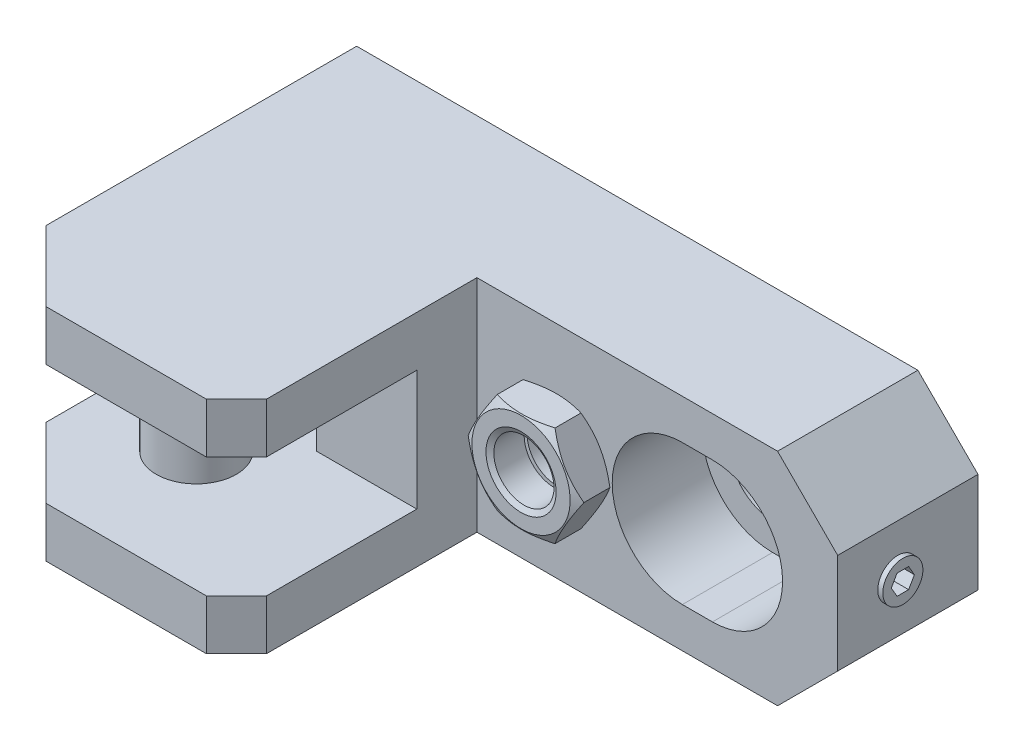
ISO-10303-21;
HEADER;
FILE_DESCRIPTION(('STEP AP214'),'2;1');
FILE_NAME('part.step','',(''),(''),'','','');
FILE_SCHEMA(('AUTOMOTIVE_DESIGN { 1 0 10303 214 1 1 1 1 }'));
ENDSEC;
DATA;
#1=APPLICATION_CONTEXT('core data for automotive mechanical design processes');
#2=APPLICATION_PROTOCOL_DEFINITION('international standard','automotive_design',2000,#1);
#3=PRODUCT_CONTEXT('',#1,'mechanical');
#4=PRODUCT('Part','Part','',(#3));
#5=PRODUCT_RELATED_PRODUCT_CATEGORY('part','',(#4));
#6=PRODUCT_DEFINITION_FORMATION('','',#4);
#7=PRODUCT_DEFINITION_CONTEXT('part definition',#1,'design');
#8=PRODUCT_DEFINITION('design','',#6,#7);
#9=PRODUCT_DEFINITION_SHAPE('','',#8);
#10=(LENGTH_UNIT() NAMED_UNIT(*) SI_UNIT(.MILLI.,.METRE.));
#11=(NAMED_UNIT(*) PLANE_ANGLE_UNIT() SI_UNIT($,.RADIAN.));
#12=(NAMED_UNIT(*) SI_UNIT($,.STERADIAN.) SOLID_ANGLE_UNIT());
#13=UNCERTAINTY_MEASURE_WITH_UNIT(LENGTH_MEASURE(1.E-05),#10,'distance_accuracy_value','');
#14=(GEOMETRIC_REPRESENTATION_CONTEXT(3) GLOBAL_UNCERTAINTY_ASSIGNED_CONTEXT((#13)) GLOBAL_UNIT_ASSIGNED_CONTEXT((#10,
#11,#12)) REPRESENTATION_CONTEXT('',''));
#15=CARTESIAN_POINT('',(0.,0.,0.));
#16=DIRECTION('',(0.,0.,1.));
#17=DIRECTION('',(1.,0.,0.));
#18=AXIS2_PLACEMENT_3D('',#15,#16,#17);
#19=CARTESIAN_POINT('',(10.499999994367,-6.46076379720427E-09,9.15470053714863));
#20=DIRECTION('',(-8.40528659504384E-10,-0.5,0.866025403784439));
#21=DIRECTION('',(0.,-0.866025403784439,-0.5));
#22=AXIS2_PLACEMENT_3D('',#19,#20,#21);
#23=PLANE('',#22);
#24=DIRECTION('',(1.,-6.15311326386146E-10,0.));
#25=VECTOR('',#24,1.);
#26=CARTESIAN_POINT('',(10.499999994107,-1.00000000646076,8.57735026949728));
#27=LINE('',#26,#25);
#28=CARTESIAN_POINT('',(12.9999999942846,-1.00000000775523,8.57735026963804));
#29=VERTEX_POINT('',#28);
#30=CARTESIAN_POINT('',(10.499999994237,-1.00000000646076,8.57735026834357));
#31=VERTEX_POINT('',#30);
#32=EDGE_CURVE('E1164',#29,#31,#27,.F.);
#33=ORIENTED_EDGE('',*,*,#32,.T.);
#34=DIRECTION('',(0.,-0.866025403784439,-0.5));
#35=VECTOR('',#34,1.);
#36=CARTESIAN_POINT('',(10.499999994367,-6.46076379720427E-09,9.15470053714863));
#37=LINE('',#36,#35);
#38=CARTESIAN_POINT('',(10.4999999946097,-6.70457156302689E-09,9.15470053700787));
#39=VERTEX_POINT('',#38);
#40=EDGE_CURVE('E1168',#39,#31,#37,.T.);
#41=ORIENTED_EDGE('',*,*,#40,.F.);
#42=DIRECTION('',(1.,1.12609794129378E-10,1.95045884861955E-10));
#43=VECTOR('',#42,1.);
#44=CARTESIAN_POINT('',(10.4999999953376,-6.46076443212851E-09,9.15470053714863));
#45=LINE('',#44,#43);
#46=CARTESIAN_POINT('',(12.999999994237,-7.54409034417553E-09,9.15470053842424));
#47=VERTEX_POINT('',#46);
#48=EDGE_CURVE('E1189',#39,#47,#45,.T.);
#49=ORIENTED_EDGE('',*,*,#48,.T.);
#50=DIRECTION('',(0.,-0.866025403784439,-0.5));
#51=VECTOR('',#50,1.);
#52=CARTESIAN_POINT('',(12.999999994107,-7.51142462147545E-09,9.15470053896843));
#53=LINE('',#52,#51);
#54=EDGE_CURVE('E1172',#29,#47,#53,.F.);
#55=ORIENTED_EDGE('',*,*,#54,.F.);
#56=EDGE_LOOP('',(#33,#41,#49,#55));
#57=FACE_BOUND('',#56,.T.);
#58=ADVANCED_FACE('F14',(#57),#23,.F.);
#59=CARTESIAN_POINT('',(10.499999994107,-1.00000000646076,8.577350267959));
#60=DIRECTION('',(-6.15311326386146E-10,-1.,0.));
#61=DIRECTION('',(1.,-6.15311326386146E-10,0.));
#62=AXIS2_PLACEMENT_3D('',#59,#60,#61);
#63=PLANE('',#62);
#64=DIRECTION('',(1.,1.12609794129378E-10,1.95045884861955E-10));
#65=VECTOR('',#64,1.);
#66=CARTESIAN_POINT('',(10.4999999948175,-1.00000000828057,7.42264973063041));
#67=LINE('',#66,#65);
#68=CARTESIAN_POINT('',(12.9999999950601,-1.00000000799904,7.42264973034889));
#69=VERTEX_POINT('',#68);
#70=CARTESIAN_POINT('',(10.4999999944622,-1.00000000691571,7.42264972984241));
#71=VERTEX_POINT('',#70);
#72=EDGE_CURVE('E1188',#69,#71,#67,.F.);
#73=ORIENTED_EDGE('',*,*,#72,.T.);
#74=DIRECTION('',(0.,0.,1.));
#75=VECTOR('',#74,1.);
#76=CARTESIAN_POINT('',(10.499999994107,-1.00000000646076,8.577350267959));
#77=LINE('',#76,#75);
#78=EDGE_CURVE('E1178',#31,#71,#77,.F.);
#79=ORIENTED_EDGE('',*,*,#78,.F.);
#80=ORIENTED_EDGE('',*,*,#32,.F.);
#81=DIRECTION('',(0.,0.,1.));
#82=VECTOR('',#81,1.);
#83=CARTESIAN_POINT('',(12.9999999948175,-1.00000000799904,8.577350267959));
#84=LINE('',#83,#82);
#85=EDGE_CURVE('E1181',#69,#29,#84,.T.);
#86=ORIENTED_EDGE('',*,*,#85,.F.);
#87=EDGE_LOOP('',(#73,#79,#80,#86));
#88=FACE_BOUND('',#87,.T.);
#89=ADVANCED_FACE('F1117',(#88),#63,.F.);
#90=CARTESIAN_POINT('',(10.4999999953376,0.999999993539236,8.577350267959));
#91=DIRECTION('',(-2.25219588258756E-10,0.5,0.866025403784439));
#92=DIRECTION('',(0.,-0.866025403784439,0.5));
#93=AXIS2_PLACEMENT_3D('',#90,#91,#92);
#94=PLANE('',#93);
#95=ORIENTED_EDGE('',*,*,#48,.F.);
#96=DIRECTION('',(-8.40528492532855E-10,-0.866025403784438,0.5));
#97=VECTOR('',#96,1.);
#98=CARTESIAN_POINT('',(10.4999999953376,0.999999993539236,8.577350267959));
#99=LINE('',#98,#97);
#100=CARTESIAN_POINT('',(10.4999999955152,0.999999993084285,8.57735026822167));
#101=VERTEX_POINT('',#100);
#102=EDGE_CURVE('E1197',#101,#39,#99,.T.);
#103=ORIENTED_EDGE('',*,*,#102,.F.);
#104=DIRECTION('',(-1.,6.15311326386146E-10,0.));
#105=VECTOR('',#104,1.);
#106=CARTESIAN_POINT('',(10.4999999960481,0.999999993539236,8.577350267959));
#107=LINE('',#106,#105);
#108=CARTESIAN_POINT('',(12.9999999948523,0.999999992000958,8.57735026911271));
#109=VERTEX_POINT('',#108);
#110=EDGE_CURVE('E1204',#101,#109,#107,.F.);
#111=ORIENTED_EDGE('',*,*,#110,.T.);
#112=DIRECTION('',(0.,-0.866025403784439,0.5));
#113=VECTOR('',#112,1.);
#114=CARTESIAN_POINT('',(12.999999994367,0.99999999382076,8.57735026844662));
#115=LINE('',#114,#113);
#116=EDGE_CURVE('E1186',#47,#109,#115,.F.);
#117=ORIENTED_EDGE('',*,*,#116,.F.);
#118=EDGE_LOOP('',(#95,#103,#111,#117));
#119=FACE_BOUND('',#118,.T.);
#120=ADVANCED_FACE('F1108',(#119),#94,.F.);
#121=CARTESIAN_POINT('',(10.4999999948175,-1.00000000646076,7.42264972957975));
#122=DIRECTION('',(2.25219588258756E-10,-0.5,-0.866025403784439));
#123=DIRECTION('',(0.,0.866025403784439,-0.5));
#124=AXIS2_PLACEMENT_3D('',#121,#122,#123);
#125=PLANE('',#124);
#126=DIRECTION('',(1.,-4.20264329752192E-10,7.27919171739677E-10));
#127=VECTOR('',#126,1.);
#128=CARTESIAN_POINT('',(10.499999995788,-6.94837939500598E-09,6.8452994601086));
#129=LINE('',#128,#127);
#130=CARTESIAN_POINT('',(12.999999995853,-7.08914076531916E-09,6.84529946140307));
#131=VERTEX_POINT('',#130);
#132=CARTESIAN_POINT('',(10.4999999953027,-6.58266817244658E-09,6.84529946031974));
#133=VERTEX_POINT('',#132);
#134=EDGE_CURVE('E332',#131,#133,#129,.F.);
#135=ORIENTED_EDGE('',*,*,#134,.T.);
#136=DIRECTION('',(8.40528492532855E-10,0.86602540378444,-0.5));
#137=VECTOR('',#136,1.);
#138=CARTESIAN_POINT('',(10.4999999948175,-1.00000000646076,7.42264972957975));
#139=LINE('',#138,#137);
#140=EDGE_CURVE('E1194',#71,#133,#139,.T.);
#141=ORIENTED_EDGE('',*,*,#140,.F.);
#142=ORIENTED_EDGE('',*,*,#72,.F.);
#143=DIRECTION('',(0.,0.866025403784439,-0.5));
#144=VECTOR('',#143,1.);
#145=CARTESIAN_POINT('',(12.999999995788,-1.00000000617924,7.42264973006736));
#146=LINE('',#145,#144);
#147=EDGE_CURVE('E1191',#131,#69,#146,.F.);
#148=ORIENTED_EDGE('',*,*,#147,.F.);
#149=EDGE_LOOP('',(#135,#141,#142,#148));
#150=FACE_BOUND('',#149,.T.);
#151=ADVANCED_FACE('F1099',(#150),#125,.F.);
#152=CARTESIAN_POINT('',(10.499999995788,-6.4607641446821E-09,6.84529946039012));
#153=DIRECTION('',(1.,-6.15309071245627E-10,6.15310037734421E-10));
#154=DIRECTION('',(6.15310037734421E-10,0.,-1.));
#155=AXIS2_PLACEMENT_3D('',#152,#153,#154);
#156=PLANE('',#155);
#157=ORIENTED_EDGE('',*,*,#40,.T.);
#158=ORIENTED_EDGE('',*,*,#78,.T.);
#159=ORIENTED_EDGE('',*,*,#140,.T.);
#160=DIRECTION('',(0.,0.866025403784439,0.5));
#161=VECTOR('',#160,1.);
#162=CARTESIAN_POINT('',(10.499999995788,-6.46076384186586E-09,6.84529946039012));
#163=LINE('',#162,#161);
#164=CARTESIAN_POINT('',(10.4999999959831,0.999999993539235,7.42264972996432));
#165=VERTEX_POINT('',#164);
#166=EDGE_CURVE('E1211',#133,#165,#163,.T.);
#167=ORIENTED_EDGE('',*,*,#166,.T.);
#168=DIRECTION('',(0.,0.,1.));
#169=VECTOR('',#168,1.);
#170=CARTESIAN_POINT('',(10.4999999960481,0.999999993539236,7.42264972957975));
#171=LINE('',#170,#169);
#172=EDGE_CURVE('E1200',#165,#101,#171,.T.);
#173=ORIENTED_EDGE('',*,*,#172,.T.);
#174=ORIENTED_EDGE('',*,*,#102,.T.);
#175=EDGE_LOOP('',(#157,#158,#159,#167,#173,#174));
#176=FACE_BOUND('',#175,.T.);
#177=ADVANCED_FACE('F1090',(#176),#156,.T.);
#178=CARTESIAN_POINT('',(10.4999999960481,0.999999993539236,7.42264972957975));
#179=DIRECTION('',(6.15311326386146E-10,1.,0.));
#180=DIRECTION('',(-1.,6.15311326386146E-10,0.));
#181=AXIS2_PLACEMENT_3D('',#178,#179,#180);
#182=PLANE('',#181);
#183=ORIENTED_EDGE('',*,*,#110,.F.);
#184=ORIENTED_EDGE('',*,*,#172,.F.);
#185=DIRECTION('',(1.,-4.20264329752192E-10,7.27919171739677E-10));
#186=VECTOR('',#185,1.);
#187=CARTESIAN_POINT('',(10.499999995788,0.999999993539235,7.42264972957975));
#188=LINE('',#187,#186);
#189=CARTESIAN_POINT('',(12.9999999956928,0.999999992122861,7.42264973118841));
#190=VERTEX_POINT('',#189);
#191=EDGE_CURVE('E1209',#165,#190,#188,.T.);
#192=ORIENTED_EDGE('',*,*,#191,.T.);
#193=DIRECTION('',(0.,0.,1.));
#194=VECTOR('',#193,1.);
#195=CARTESIAN_POINT('',(12.9999999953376,0.999999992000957,7.42264972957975));
#196=LINE('',#195,#194);
#197=EDGE_CURVE('E157',#109,#190,#196,.F.);
#198=ORIENTED_EDGE('',*,*,#197,.F.);
#199=EDGE_LOOP('',(#183,#184,#192,#198));
#200=FACE_BOUND('',#199,.T.);
#201=ADVANCED_FACE('F1081',(#200),#182,.F.);
#202=CARTESIAN_POINT('',(-15.5000000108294,9.5373017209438E-09,17.5999999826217));
#203=DIRECTION('',(-6.1531038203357E-10,0.,1.));
#204=DIRECTION('',(1.,0.,6.1531038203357E-10));
#205=AXIS2_PLACEMENT_3D('',#202,#203,#204);
#206=CONICAL_SURFACE('',#205,3.49999999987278,1.04719755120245);
#207=CARTESIAN_POINT('',(-15.5000000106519,9.53730201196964E-09,17.3113248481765));
#208=DIRECTION('',(6.15310411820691E-10,0.,-1.));
#209=DIRECTION('',(-1.,0.,-6.15310411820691E-10));
#210=AXIS2_PLACEMENT_3D('',#207,#208,#209);
#211=CIRCLE('',#210,3.);
#212=CARTESIAN_POINT('',(-18.5000000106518,9.53730201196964E-09,17.3113248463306));
#213=VERTEX_POINT('',#212);
#214=EDGE_CURVE('E329',#213,#213,#211,.T.);
#215=ORIENTED_EDGE('',*,*,#214,.T.);
#216=EDGE_LOOP('',(#215));
#217=FACE_BOUND('',#216,.T.);
#218=CARTESIAN_POINT('',(-15.5000000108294,9.5373017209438E-09,17.5999999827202));
#219=DIRECTION('',(-6.1531038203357E-10,0.,1.));
#220=DIRECTION('',(1.,0.,6.1531038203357E-10));
#221=AXIS2_PLACEMENT_3D('',#218,#219,#220);
#222=CIRCLE('',#221,3.50000000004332);
#223=CARTESIAN_POINT('',(-12.0000000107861,9.5373017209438E-09,17.5999999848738));
#224=VERTEX_POINT('',#223);
#225=EDGE_CURVE('E18',#224,#224,#222,.F.);
#226=ORIENTED_EDGE('',*,*,#225,.F.);
#227=EDGE_LOOP('',(#226));
#228=FACE_BOUND('',#227,.T.);
#229=ADVANCED_FACE('F1072',(#217,#228),#206,.F.);
#230=CARTESIAN_POINT('',(-15.5000000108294,9.53730173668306E-09,17.5999999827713));
#231=DIRECTION('',(6.15310411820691E-10,0.,-1.));
#232=DIRECTION('',(-1.,0.,-6.15310411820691E-10));
#233=AXIS2_PLACEMENT_3D('',#230,#231,#232);
#234=CYLINDRICAL_SURFACE('',#233,3.);
#235=ORIENTED_EDGE('',*,*,#214,.F.);
#236=EDGE_LOOP('',(#235));
#237=FACE_BOUND('',#236,.T.);
#238=CARTESIAN_POINT('',(-15.500000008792,9.53730489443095E-09,14.2886751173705));
#239=DIRECTION('',(6.15310411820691E-10,0.,-1.));
#240=DIRECTION('',(-6.15309886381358E-10,-1.,0.));
#241=AXIS2_PLACEMENT_3D('',#238,#239,#240);
#242=CIRCLE('',#241,2.99999999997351);
#243=CARTESIAN_POINT('',(-15.5000000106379,-2.99999999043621,14.2886751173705));
#244=VERTEX_POINT('',#243);
#245=EDGE_CURVE('E325',#244,#244,#242,.T.);
#246=ORIENTED_EDGE('',*,*,#245,.T.);
#247=EDGE_LOOP('',(#246));
#248=FACE_BOUND('',#247,.T.);
#249=ADVANCED_FACE('F1063',(#237,#248),#234,.F.);
#250=CARTESIAN_POINT('',(10.499999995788,-6.46076384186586E-09,6.84529946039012));
#251=DIRECTION('',(8.40528659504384E-10,0.5,-0.866025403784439));
#252=DIRECTION('',(0.,0.866025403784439,0.5));
#253=AXIS2_PLACEMENT_3D('',#250,#251,#252);
#254=PLANE('',#253);
#255=ORIENTED_EDGE('',*,*,#191,.F.);
#256=ORIENTED_EDGE('',*,*,#166,.F.);
#257=ORIENTED_EDGE('',*,*,#134,.F.);
#258=DIRECTION('',(-2.25217990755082E-10,-0.866025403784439,-0.5));
#259=VECTOR('',#258,1.);
#260=CARTESIAN_POINT('',(12.9999999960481,0.999999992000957,7.42264973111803));
#261=LINE('',#260,#259);
#262=EDGE_CURVE('E328',#190,#131,#261,.T.);
#263=ORIENTED_EDGE('',*,*,#262,.F.);
#264=EDGE_LOOP('',(#255,#256,#257,#263));
#265=FACE_BOUND('',#264,.T.);
#266=ADVANCED_FACE('F1054',(#265),#254,.F.);
#267=CARTESIAN_POINT('',(-21.2735027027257,1.30897984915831E-08,17.5999999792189));
#268=DIRECTION('',(-6.1531041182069E-10,0.,1.));
#269=DIRECTION('',(1.,0.,6.1531041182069E-10));
#270=AXIS2_PLACEMENT_3D('',#267,#268,#269);
#271=PLANE('',#270);
#272=CARTESIAN_POINT('',(-15.5000000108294,9.53730163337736E-09,17.5999999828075));
#273=DIRECTION('',(6.15310501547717E-10,0.,-1.));
#274=DIRECTION('',(-1.,0.,-6.15310501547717E-10));
#275=AXIS2_PLACEMENT_3D('',#272,#273,#274);
#276=CIRCLE('',#275,4.90000000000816);
#277=CARTESIAN_POINT('',(-20.4000000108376,9.53730163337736E-09,17.5999999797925));
#278=VERTEX_POINT('',#277);
#279=EDGE_CURVE('E1215',#278,#278,#276,.T.);
#280=ORIENTED_EDGE('',*,*,#279,.F.);
#281=EDGE_LOOP('',(#280));
#282=FACE_BOUND('',#281,.T.);
#283=ORIENTED_EDGE('',*,*,#225,.T.);
#284=EDGE_LOOP('',(#283));
#285=FACE_BOUND('',#284,.T.);
#286=ADVANCED_FACE('F1046',(#282,#285),#271,.T.);
#287=CARTESIAN_POINT('',(-15.5000000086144,9.53730497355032E-09,13.9999999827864));
#288=DIRECTION('',(6.1531038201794E-10,0.,-1.));
#289=DIRECTION('',(-1.,0.,-6.1531038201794E-10));
#290=AXIS2_PLACEMENT_3D('',#287,#288,#289);
#291=CONICAL_SURFACE('',#290,3.49999999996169,1.04719755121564);
#292=ORIENTED_EDGE('',*,*,#245,.F.);
#293=EDGE_LOOP('',(#292));
#294=FACE_BOUND('',#293,.T.);
#295=CARTESIAN_POINT('',(-15.5000000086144,9.53730497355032E-09,13.9999999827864));
#296=DIRECTION('',(6.1531038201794E-10,0.,-1.));
#297=DIRECTION('',(-1.,0.,-6.1531038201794E-10));
#298=AXIS2_PLACEMENT_3D('',#295,#296,#297);
#299=CIRCLE('',#298,3.49999999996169);
#300=CARTESIAN_POINT('',(-19.000000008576,9.53730497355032E-09,13.9999999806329));
#301=VERTEX_POINT('',#300);
#302=EDGE_CURVE('E1218',#301,#301,#299,.T.);
#303=ORIENTED_EDGE('',*,*,#302,.T.);
#304=EDGE_LOOP('',(#303));
#305=FACE_BOUND('',#304,.T.);
#306=ADVANCED_FACE('F1038',(#294,#305),#291,.F.);
#307=CARTESIAN_POINT('',(12.9999999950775,-7.99904203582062E-09,8.00000000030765));
#308=DIRECTION('',(1.,-6.15309071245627E-10,6.15310037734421E-10));
#309=DIRECTION('',(6.15310037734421E-10,0.,-1.));
#310=AXIS2_PLACEMENT_3D('',#307,#308,#309);
#311=PLANE('',#310);
#312=CARTESIAN_POINT('',(12.9999999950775,-7.99904203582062E-09,8.00000000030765));
#313=DIRECTION('',(-1.,6.15311326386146E-10,-6.15310037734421E-10));
#314=DIRECTION('',(-6.15311326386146E-10,-1.,0.));
#315=AXIS2_PLACEMENT_3D('',#312,#313,#314);
#316=CIRCLE('',#315,2.);
#317=CARTESIAN_POINT('',(12.9999999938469,-2.00000000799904,8.00000000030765));
#318=VERTEX_POINT('',#317);
#319=EDGE_CURVE('E441',#318,#318,#316,.T.);
#320=ORIENTED_EDGE('',*,*,#319,.F.);
#321=EDGE_LOOP('',(#320));
#322=FACE_BOUND('',#321,.T.);
#323=ORIENTED_EDGE('',*,*,#197,.T.);
#324=ORIENTED_EDGE('',*,*,#262,.T.);
#325=ORIENTED_EDGE('',*,*,#147,.T.);
#326=ORIENTED_EDGE('',*,*,#85,.T.);
#327=ORIENTED_EDGE('',*,*,#54,.T.);
#328=ORIENTED_EDGE('',*,*,#116,.T.);
#329=EDGE_LOOP('',(#323,#324,#325,#326,#327,#328));
#330=FACE_BOUND('',#329,.T.);
#331=ADVANCED_FACE('F454',(#322,#330),#311,.T.);
#332=CARTESIAN_POINT('',(-15.5000000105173,9.53730193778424E-09,17.0926570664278));
#333=DIRECTION('',(6.15310501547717E-10,0.,-1.));
#334=DIRECTION('',(-1.,0.,-6.15310501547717E-10));
#335=AXIS2_PLACEMENT_3D('',#332,#333,#334);
#336=CONICAL_SURFACE('',#335,5.77874370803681,1.04719755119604);
#337=ORIENTED_EDGE('',*,*,#279,.T.);
#338=EDGE_LOOP('',(#337));
#339=FACE_BOUND('',#338,.T.);
#340=CARTESIAN_POINT('',(-9.72649731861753,5.97552079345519E-09,17.0956829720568));
#341=CARTESIAN_POINT('',(-9.85335919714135,0.219731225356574,17.1689395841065));
#342=CARTESIAN_POINT('',(-9.98130613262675,0.441341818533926,17.235569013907));
#343=CARTESIAN_POINT('',(-10.2394153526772,0.88840010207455,17.3518692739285));
#344=CARTESIAN_POINT('',(-10.3695822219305,1.11385573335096,17.4014989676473));
#345=CARTESIAN_POINT('',(-10.6283226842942,1.56200736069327,17.4787386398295));
#346=CARTESIAN_POINT('',(-10.7568559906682,1.78463357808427,17.5068631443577));
#347=CARTESIAN_POINT('',(-10.9501079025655,2.11935570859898,17.5320796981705));
#348=CARTESIAN_POINT('',(-11.0145692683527,2.23100606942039,17.5376582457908));
#349=CARTESIAN_POINT('',(-11.1435515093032,2.45440986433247,17.5430638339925));
#350=CARTESIAN_POINT('',(-11.2080723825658,2.56616329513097,17.5428910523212));
#351=CARTESIAN_POINT('',(-11.3848264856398,2.87231038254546,17.5345032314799));
#352=CARTESIAN_POINT('',(-11.4970011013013,3.06660251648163,17.5204259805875));
#353=CARTESIAN_POINT('',(-11.7206058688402,3.45389733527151,17.4757934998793));
#354=CARTESIAN_POINT('',(-11.8320352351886,3.6468986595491,17.4452230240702));
#355=CARTESIAN_POINT('',(-12.0560902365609,4.03497330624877,17.3688072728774));
#356=CARTESIAN_POINT('',(-12.1686876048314,4.22999766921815,17.3226383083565));
#357=CARTESIAN_POINT('',(-12.392203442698,4.61713845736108,17.2178541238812));
#358=CARTESIAN_POINT('',(-12.5031247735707,4.8092598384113,17.1592635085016));
#359=CARTESIAN_POINT('',(-12.6132486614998,5.00000000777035,17.0956829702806));
#360=B_SPLINE_CURVE_WITH_KNOTS('',3,(#340,#341,#342,#343,#344,#345,#346,#347,#348,#349,#350,
#351,#352,#353,#354,#355,#356,#357,#358,#359),.UNSPECIFIED.,.F.,.F.,(4,2,2,2,2,2,2,2,2,4),(0.,
0.792540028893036,1.5869845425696,2.36176901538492,2.74878733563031,3.1357936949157,
3.80946092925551,4.48375195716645,5.17299552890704,5.86088640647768),.UNSPECIFIED.);
#361=CARTESIAN_POINT('',(-9.72649731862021,5.98016331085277E-09,17.0956829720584));
#362=VERTEX_POINT('',#361);
#363=CARTESIAN_POINT('',(-12.6132486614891,5.00000000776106,17.0956829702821));
#364=VERTEX_POINT('',#363);
#365=EDGE_CURVE('E460',#362,#364,#360,.T.);
#366=ORIENTED_EDGE('',*,*,#365,.T.);
#367=CARTESIAN_POINT('',(-12.6132486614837,5.00000000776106,17.0956829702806));
#368=CARTESIAN_POINT('',(-12.8502223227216,5.00000000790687,17.1640985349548));
#369=CARTESIAN_POINT('',(-13.0890706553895,5.00000000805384,17.2267349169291));
#370=CARTESIAN_POINT('',(-13.5706472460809,5.00000000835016,17.3374369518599));
#371=CARTESIAN_POINT('',(-13.813382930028,5.00000000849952,17.3854700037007));
#372=CARTESIAN_POINT('',(-14.2961305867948,5.00000000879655,17.4627129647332));
#373=CARTESIAN_POINT('',(-14.5360745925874,5.00000000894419,17.4923347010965));
#374=CARTESIAN_POINT('',(-15.017346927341,5.00000000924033,17.5321001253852));
#375=CARTESIAN_POINT('',(-15.2586734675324,5.00000000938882,17.5422649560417));
#376=CARTESIAN_POINT('',(-15.7413265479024,5.0000000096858,17.5422649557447));
#377=CARTESIAN_POINT('',(-15.982653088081,5.00000000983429,17.5321001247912));
#378=CARTESIAN_POINT('',(-16.4639254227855,5.00000001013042,17.4923346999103));
#379=CARTESIAN_POINT('',(-16.7038694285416,5.00000001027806,17.4627129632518));
#380=CARTESIAN_POINT('',(-17.1866170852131,5.0000000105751,17.3854700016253));
#381=CARTESIAN_POINT('',(-17.429352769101,5.00000001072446,17.3374369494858));
#382=CARTESIAN_POINT('',(-17.910929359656,5.00000001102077,17.2267349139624));
#383=CARTESIAN_POINT('',(-18.1497776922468,5.00000001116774,17.1640985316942));
#384=CARTESIAN_POINT('',(-18.3867513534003,5.00000001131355,17.0956829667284));
#385=B_SPLINE_CURVE_WITH_KNOTS('',3,(#367,#368,#369,#370,#371,#372,#373,#374,#375,#376,#377,
#378,#379,#380,#381,#382,#383,#384),.UNSPECIFIED.,.F.,.F.,(4,2,2,2,2,2,2,2,4),(0.,
0.740183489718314,1.4820074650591,2.20657714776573,2.93035903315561,3.65414091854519,
4.37871060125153,5.12053457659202,5.86071806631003),.UNSPECIFIED.);
#386=CARTESIAN_POINT('',(-18.3867513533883,5.00000001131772,17.0956829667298));
#387=VERTEX_POINT('',#386);
#388=EDGE_CURVE('E468',#364,#387,#385,.T.);
#389=ORIENTED_EDGE('',*,*,#388,.T.);
#390=CARTESIAN_POINT('',(-18.3867513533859,5.00000001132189,17.0956829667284));
#391=CARTESIAN_POINT('',(-18.5136132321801,4.78026879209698,17.1689395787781));
#392=CARTESIAN_POINT('',(-18.6415601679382,4.5586581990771,17.2355690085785));
#393=CARTESIAN_POINT('',(-18.8996693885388,4.11159991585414,17.3518692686));
#394=CARTESIAN_POINT('',(-19.0298362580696,3.88614428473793,17.4014989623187));
#395=CARTESIAN_POINT('',(-19.2885767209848,3.43799265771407,17.4787386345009));
#396=CARTESIAN_POINT('',(-19.4171100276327,3.21536644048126,17.5068631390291));
#397=CARTESIAN_POINT('',(-19.6103619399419,2.88064431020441,17.5320796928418));
#398=CARTESIAN_POINT('',(-19.6748233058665,2.76899394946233,17.5376582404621));
#399=CARTESIAN_POINT('',(-19.8038055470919,2.545590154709,17.5430638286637));
#400=CARTESIAN_POINT('',(-19.868326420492,2.43383672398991,17.5428910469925));
#401=CARTESIAN_POINT('',(-20.0450805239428,2.127689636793,17.5345032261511));
#402=CARTESIAN_POINT('',(-20.1572551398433,1.93339750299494,17.5204259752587));
#403=CARTESIAN_POINT('',(-20.3808599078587,1.54610268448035,17.4757934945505));
#404=CARTESIAN_POINT('',(-20.4922892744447,1.35310136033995,17.4452230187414));
#405=CARTESIAN_POINT('',(-20.7163442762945,0.965026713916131,17.3688072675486));
#406=CARTESIAN_POINT('',(-20.8289416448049,0.77000235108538,17.3226383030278));
#407=CARTESIAN_POINT('',(-21.0524574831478,0.382861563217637,17.2178541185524));
#408=CARTESIAN_POINT('',(-21.163378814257,0.190740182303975,17.1592635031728));
#409=CARTESIAN_POINT('',(-21.2735027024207,1.30805066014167E-08,17.0956829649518));
#410=B_SPLINE_CURVE_WITH_KNOTS('',3,(#390,#391,#392,#393,#394,#395,#396,#397,#398,#399,#400,
#401,#402,#403,#404,#405,#406,#407,#408,#409),.UNSPECIFIED.,.F.,.F.,(4,2,2,2,2,2,2,2,2,4),(0.,
0.792540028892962,1.58698454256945,2.3617690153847,2.74878733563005,3.1357936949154,
3.80946092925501,4.48375195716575,5.17299552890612,5.86088640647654),.UNSPECIFIED.);
#411=CARTESIAN_POINT('',(-21.2735027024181,1.30944410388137E-08,17.0956829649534));
#412=VERTEX_POINT('',#411);
#413=EDGE_CURVE('E440',#387,#412,#410,.T.);
#414=ORIENTED_EDGE('',*,*,#413,.T.);
#415=CARTESIAN_POINT('',(-21.2735027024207,1.30990860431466E-08,17.0956829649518));
#416=CARTESIAN_POINT('',(-21.1466408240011,-0.219731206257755,17.1689395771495));
#417=CARTESIAN_POINT('',(-21.018693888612,-0.441341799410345,17.2355690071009));
#418=CARTESIAN_POINT('',(-20.7605846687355,-0.888400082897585,17.3518692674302));
#419=CARTESIAN_POINT('',(-20.6304177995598,-1.11385571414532,17.4014989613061));
#420=CARTESIAN_POINT('',(-20.3716773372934,-1.56200734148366,17.4787386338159));
#421=CARTESIAN_POINT('',(-20.2431440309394,-1.78463355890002,17.5068631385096));
#422=CARTESIAN_POINT('',(-20.0498921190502,-2.11935568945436,17.5320796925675));
#423=CARTESIAN_POINT('',(-19.9854307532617,-2.23100605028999,17.537658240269));
#424=CARTESIAN_POINT('',(-19.8564485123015,-2.45440984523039,17.5430638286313));
#425=CARTESIAN_POINT('',(-19.7919276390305,-2.566163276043,17.5428910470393));
#426=CARTESIAN_POINT('',(-19.6151735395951,-2.87231035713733,17.5345032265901));
#427=CARTESIAN_POINT('',(-19.5029989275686,-3.06660248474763,17.5204259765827));
#428=CARTESIAN_POINT('',(-19.2793941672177,-3.45389729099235,17.475793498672));
#429=CARTESIAN_POINT('',(-19.1679648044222,-3.64689860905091,17.4452230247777));
#430=CARTESIAN_POINT('',(-18.9439098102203,-4.03497324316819,17.3688072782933));
#431=CARTESIAN_POINT('',(-18.8313124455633,-4.22999759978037,17.3226383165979));
#432=CARTESIAN_POINT('',(-18.607796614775,-4.61713837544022,17.2178541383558));
#433=CARTESIAN_POINT('',(-18.4968752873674,-4.80925975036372,17.1592635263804));
#434=CARTESIAN_POINT('',(-18.3867514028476,-4.99999991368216,17.0956829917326));
#435=B_SPLINE_CURVE_WITH_KNOTS('',3,(#415,#416,#417,#418,#419,#420,#421,#422,#423,#424,#425,
#426,#427,#428,#429,#430,#431,#432,#433,#434),.UNSPECIFIED.,.F.,.F.,(4,2,2,2,2,2,2,2,2,4),(0.,
0.792540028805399,1.58698454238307,2.36176901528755,2.7487873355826,3.13579369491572,
3.80946090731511,4.48375191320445,5.17299546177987,5.86088631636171),.UNSPECIFIED.);
#436=CARTESIAN_POINT('',(-18.386751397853,-4.99999995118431,17.0956829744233));
#437=VERTEX_POINT('',#436);
#438=EDGE_CURVE('E148',#412,#437,#435,.T.);
#439=ORIENTED_EDGE('',*,*,#438,.T.);
#440=CARTESIAN_POINT('',(-18.3867513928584,-4.99999998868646,17.0956829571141));
#441=CARTESIAN_POINT('',(-18.1497777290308,-4.99999998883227,17.1640985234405));
#442=CARTESIAN_POINT('',(-17.9109293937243,-4.99999998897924,17.2267349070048));
#443=CARTESIAN_POINT('',(-17.4293527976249,-4.99999998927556,17.3374369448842));
#444=CARTESIAN_POINT('',(-17.1866171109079,-4.99999998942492,17.3854699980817));
#445=CARTESIAN_POINT('',(-16.7038694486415,-4.99999998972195,17.4627129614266));
#446=CARTESIAN_POINT('',(-16.4639254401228,-4.99999998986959,17.4923346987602));
#447=CARTESIAN_POINT('',(-15.982653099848,-4.99999999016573,17.5321001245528));
#448=CARTESIAN_POINT('',(-15.7413265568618,-4.99999999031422,17.5422649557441));
#449=CARTESIAN_POINT('',(-15.2586734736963,-4.9999999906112,17.5422649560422));
#450=CARTESIAN_POINT('',(-15.0173469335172,-4.99999999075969,17.5321001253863));
#451=CARTESIAN_POINT('',(-14.5360745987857,-4.99999999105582,17.492334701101));
#452=CARTESIAN_POINT('',(-14.2961305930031,-4.99999999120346,17.4627129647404));
#453=CARTESIAN_POINT('',(-13.8133829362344,-4.9999999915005,17.3854700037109));
#454=CARTESIAN_POINT('',(-13.5706472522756,-4.99999999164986,17.3374369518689));
#455=CARTESIAN_POINT('',(-13.0890706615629,-4.99999999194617,17.2267349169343));
#456=CARTESIAN_POINT('',(-12.8502223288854,-4.99999999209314,17.1640985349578));
#457=CARTESIAN_POINT('',(-12.6132486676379,-4.99999999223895,17.0956829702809));
#458=B_SPLINE_CURVE_WITH_KNOTS('',3,(#440,#441,#442,#443,#444,#445,#446,#447,#448,#449,#450,
#451,#452,#453,#454,#455,#456,#457),.UNSPECIFIED.,.F.,.F.,(4,2,2,2,2,2,2,2,4),(0.,
0.740183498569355,1.48200748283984,2.20657717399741,2.93035906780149,3.65414095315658,
4.37871063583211,5.12053461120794,5.86071810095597),.UNSPECIFIED.);
#459=CARTESIAN_POINT('',(-12.61324866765,-4.99999999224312,17.0956829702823));
#460=VERTEX_POINT('',#459);
#461=EDGE_CURVE('E475',#437,#460,#458,.T.);
#462=ORIENTED_EDGE('',*,*,#461,.T.);
#463=CARTESIAN_POINT('',(-12.6132486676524,-4.99999999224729,17.0956829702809));
#464=CARTESIAN_POINT('',(-12.4863867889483,-4.78026877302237,17.1689395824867));
#465=CARTESIAN_POINT('',(-12.3584398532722,-4.55865818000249,17.2355690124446));
#466=CARTESIAN_POINT('',(-12.1003306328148,-4.11159989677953,17.3518692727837));
#467=CARTESIAN_POINT('',(-11.9701637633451,-3.88614426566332,17.4014989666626));
#468=CARTESIAN_POINT('',(-11.7114233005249,-3.43799263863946,17.4787386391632));
#469=CARTESIAN_POINT('',(-11.5828899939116,-3.21536642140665,17.5068631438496));
#470=CARTESIAN_POINT('',(-11.3896380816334,-2.88064429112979,17.5320796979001));
#471=CARTESIAN_POINT('',(-11.3251767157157,-2.76899393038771,17.5376582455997));
#472=CARTESIAN_POINT('',(-11.1961944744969,-2.54559013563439,17.5430638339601));
#473=CARTESIAN_POINT('',(-11.1316736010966,-2.4338367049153,17.5428910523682));
#474=CARTESIAN_POINT('',(-10.9549194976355,-2.1276896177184,17.5345032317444));
#475=CARTESIAN_POINT('',(-10.8427448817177,-1.93339748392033,17.52042598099));
#476=CARTESIAN_POINT('',(-10.6191401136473,-1.54610266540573,17.4757935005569));
#477=CARTESIAN_POINT('',(-10.5077107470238,-1.35310134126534,17.445223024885));
#478=CARTESIAN_POINT('',(-10.2836557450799,-0.965026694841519,17.3688072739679));
#479=CARTESIAN_POINT('',(-10.1710583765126,-0.77000233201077,17.3226383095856));
#480=CARTESIAN_POINT('',(-9.94754253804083,-0.38286154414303,17.2178541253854));
#481=CARTESIAN_POINT('',(-9.83662120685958,-0.190740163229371,17.1592635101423));
#482=CARTESIAN_POINT('',(-9.72649731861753,5.99409035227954E-09,17.0956829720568));
#483=B_SPLINE_CURVE_WITH_KNOTS('',3,(#463,#464,#465,#466,#467,#468,#469,#470,#471,#472,#473,
#474,#475,#476,#477,#478,#479,#480,#481,#482),.UNSPECIFIED.,.F.,.F.,(4,2,2,2,2,2,2,2,2,4),(0.,
0.792540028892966,1.58698454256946,2.36176901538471,2.74878733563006,3.13579369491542,
3.80946092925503,4.48375195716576,5.17299552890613,5.86088640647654),.UNSPECIFIED.);
#484=EDGE_CURVE('E486',#460,#362,#483,.T.);
#485=ORIENTED_EDGE('',*,*,#484,.T.);
#486=EDGE_LOOP('',(#366,#389,#414,#439,#462,#485));
#487=FACE_BOUND('',#486,.T.);
#488=ADVANCED_FACE('F448',(#339,#487),#336,.T.);
#489=CARTESIAN_POINT('',(-23.500000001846,11.0000000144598,13.9999999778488));
#490=DIRECTION('',(6.15310140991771E-10,0.,-1.));
#491=DIRECTION('',(-1.,0.,-6.15310140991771E-10));
#492=AXIS2_PLACEMENT_3D('',#489,#490,#491);
#493=PLANE('',#492);
#494=ORIENTED_EDGE('',*,*,#302,.F.);
#495=EDGE_LOOP('',(#494));
#496=FACE_BOUND('',#495,.T.);
#497=CARTESIAN_POINT('',(-15.5000000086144,9.53730563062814E-09,13.9999999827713));
#498=DIRECTION('',(-6.15310189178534E-10,0.,1.));
#499=DIRECTION('',(1.,0.,6.15310189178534E-10));
#500=AXIS2_PLACEMENT_3D('',#497,#498,#499);
#501=CIRCLE('',#500,3.);
#502=CARTESIAN_POINT('',(-12.5000000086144,9.53730563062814E-09,13.9999999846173));
#503=VERTEX_POINT('',#502);
#504=EDGE_CURVE('E484',#503,#503,#501,.F.);
#505=ORIENTED_EDGE('',*,*,#504,.T.);
#506=EDGE_LOOP('',(#505));
#507=FACE_BOUND('',#506,.T.);
#508=ADVANCED_FACE('F453',(#496,#507),#493,.F.);
#509=CARTESIAN_POINT('',(12.9999999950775,-7.99904203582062E-09,8.00000000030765));
#510=DIRECTION('',(-1.,6.15311326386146E-10,-6.15310037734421E-10));
#511=DIRECTION('',(-6.15311326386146E-10,-1.,0.));
#512=AXIS2_PLACEMENT_3D('',#509,#510,#511);
#513=CYLINDRICAL_SURFACE('',#512,2.);
#514=ORIENTED_EDGE('',*,*,#319,.T.);
#515=EDGE_LOOP('',(#514));
#516=FACE_BOUND('',#515,.T.);
#517=CARTESIAN_POINT('',(12.4999999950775,-7.69138637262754E-09,8.));
#518=DIRECTION('',(-1.,6.15311326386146E-10,-6.15310037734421E-10));
#519=DIRECTION('',(-6.15311326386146E-10,-1.,0.));
#520=AXIS2_PLACEMENT_3D('',#517,#518,#519);
#521=CIRCLE('',#520,2.);
#522=CARTESIAN_POINT('',(12.4999999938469,-2.00000000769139,8.));
#523=VERTEX_POINT('',#522);
#524=EDGE_CURVE('E545',#523,#523,#521,.F.);
#525=ORIENTED_EDGE('',*,*,#524,.T.);
#526=EDGE_LOOP('',(#525));
#527=FACE_BOUND('',#526,.T.);
#528=ADVANCED_FACE('F1012',(#516,#527),#513,.T.);
#529=CARTESIAN_POINT('',(-3.00000000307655,1.8459251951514E-09,4.99999999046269));
#530=DIRECTION('',(6.15310183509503E-10,0.,-1.));
#531=DIRECTION('',(-1.,0.,-6.15310183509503E-10));
#532=AXIS2_PLACEMENT_3D('',#529,#530,#531);
#533=PLANE('',#532);
#534=DIRECTION('',(-1.,6.15311152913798E-10,0.));
#535=VECTOR('',#534,1.);
#536=CARTESIAN_POINT('',(2.6150709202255E-09,4.25,4.99999999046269));
#537=LINE('',#536,#535);
#538=CARTESIAN_POINT('',(-2.99999999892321,4.25000000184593,4.99999999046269));
#539=VERTEX_POINT('',#538);
#540=CARTESIAN_POINT('',(-4.61479767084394E-10,4.25,4.99999999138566));
#541=VERTEX_POINT('',#540);
#542=EDGE_CURVE('E305',#539,#541,#537,.F.);
#543=ORIENTED_EDGE('',*,*,#542,.T.);
#544=CARTESIAN_POINT('',(-3.07654874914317E-09,0.,4.99999999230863));
#545=DIRECTION('',(-6.15310183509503E-10,0.,1.));
#546=DIRECTION('',(1.,0.,6.15310183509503E-10));
#547=AXIS2_PLACEMENT_3D('',#544,#545,#546);
#548=CIRCLE('',#547,4.25);
#549=CARTESIAN_POINT('',(-4.15334664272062E-09,-4.25,4.99999999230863));
#550=VERTEX_POINT('',#549);
#551=EDGE_CURVE('E318',#541,#550,#548,.F.);
#552=ORIENTED_EDGE('',*,*,#551,.T.);
#553=DIRECTION('',(1.,-6.15311152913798E-10,0.));
#554=VECTOR('',#553,1.);
#555=CARTESIAN_POINT('',(-2.61507178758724E-09,-4.25,4.99999999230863));
#556=LINE('',#555,#554);
#557=CARTESIAN_POINT('',(-3.00000000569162,-4.24999999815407,4.99999999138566));
#558=VERTEX_POINT('',#557);
#559=EDGE_CURVE('E314',#550,#558,#556,.F.);
#560=ORIENTED_EDGE('',*,*,#559,.T.);
#561=CARTESIAN_POINT('',(-3.00000000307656,1.84592606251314E-09,4.99999999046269));
#562=DIRECTION('',(-6.15310183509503E-10,0.,1.));
#563=DIRECTION('',(1.,0.,6.15310183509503E-10));
#564=AXIS2_PLACEMENT_3D('',#561,#562,#563);
#565=CIRCLE('',#564,4.25);
#566=EDGE_CURVE('E306',#558,#539,#565,.F.);
#567=ORIENTED_EDGE('',*,*,#566,.T.);
#568=EDGE_LOOP('',(#543,#552,#560,#567));
#569=FACE_BOUND('',#568,.T.);
#570=DIRECTION('',(1.,-6.1531028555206E-10,0.));
#571=VECTOR('',#570,1.);
#572=CARTESIAN_POINT('',(-7.38371885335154E-09,-7.,4.99999999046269));
#573=LINE('',#572,#571);
#574=CARTESIAN_POINT('',(-3.00000001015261,-6.99999999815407,4.99999999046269));
#575=VERTEX_POINT('',#574);
#576=CARTESIAN_POINT('',(-7.38372092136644E-09,-7.,4.99999999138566));
#577=VERTEX_POINT('',#576);
#578=EDGE_CURVE('E288',#575,#577,#573,.T.);
#579=ORIENTED_EDGE('',*,*,#578,.T.);
#580=CARTESIAN_POINT('',(-3.07655463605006E-09,0.,4.99999999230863));
#581=DIRECTION('',(-6.15310183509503E-10,0.,1.));
#582=DIRECTION('',(1.,0.,6.15310183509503E-10));
#583=AXIS2_PLACEMENT_3D('',#580,#581,#582);
#584=CIRCLE('',#583,7.);
#585=CARTESIAN_POINT('',(-1.53827197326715E-09,7.,4.99999999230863));
#586=VERTEX_POINT('',#585);
#587=EDGE_CURVE('E301',#577,#586,#584,.T.);
#588=ORIENTED_EDGE('',*,*,#587,.T.);
#589=DIRECTION('',(-1.,6.1531028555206E-10,0.));
#590=VECTOR('',#589,1.);
#591=CARTESIAN_POINT('',(1.23062215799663E-09,7.,4.99999999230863));
#592=LINE('',#591,#590);
#593=CARTESIAN_POINT('',(-2.99999999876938,7.00000000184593,4.99999999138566));
#594=VERTEX_POINT('',#593);
#595=EDGE_CURVE('E297',#586,#594,#592,.T.);
#596=ORIENTED_EDGE('',*,*,#595,.T.);
#597=CARTESIAN_POINT('',(-3.00000000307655,1.8459251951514E-09,4.99999999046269));
#598=DIRECTION('',(-6.15310183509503E-10,0.,1.));
#599=DIRECTION('',(1.,0.,6.15310183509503E-10));
#600=AXIS2_PLACEMENT_3D('',#597,#598,#599);
#601=CIRCLE('',#600,7.);
#602=EDGE_CURVE('E289',#594,#575,#601,.T.);
#603=ORIENTED_EDGE('',*,*,#602,.T.);
#604=EDGE_LOOP('',(#579,#588,#596,#603));
#605=FACE_BOUND('',#604,.T.);
#606=ADVANCED_FACE('F427',(#569,#605),#533,.F.);
#607=CARTESIAN_POINT('',(-21.2735027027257,1.30897988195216E-08,17.5999999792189));
#608=DIRECTION('',(0.866025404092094,0.499999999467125,5.32873410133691E-10));
#609=DIRECTION('',(-0.499999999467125,0.866025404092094,0.));
#610=AXIS2_PLACEMENT_3D('',#607,#608,#609);
#611=PLANE('',#610);
#612=CARTESIAN_POINT('',(-18.3867513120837,-4.99999999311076,14.5043170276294));
#613=CARTESIAN_POINT('',(-18.5136132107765,-4.78026878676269,14.4310603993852));
#614=CARTESIAN_POINT('',(-18.6415601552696,-4.55865819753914,14.3644309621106));
#615=CARTESIAN_POINT('',(-18.8996693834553,-4.11159991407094,14.2481306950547));
#616=CARTESIAN_POINT('',(-19.029836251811,-3.88614427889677,14.1985010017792));
#617=CARTESIAN_POINT('',(-19.2885767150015,-3.43799264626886,14.1212613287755));
#618=CARTESIAN_POINT('',(-19.417110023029,-3.21536642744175,14.0931368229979));
#619=CARTESIAN_POINT('',(-19.6103619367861,-2.88064429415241,14.067920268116));
#620=CARTESIAN_POINT('',(-19.674823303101,-2.76899393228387,14.0623417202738));
#621=CARTESIAN_POINT('',(-19.8038055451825,-2.5455901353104,14.0569361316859));
#622=CARTESIAN_POINT('',(-19.8683264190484,-2.43383670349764,14.0571089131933));
#623=CARTESIAN_POINT('',(-20.0450805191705,-2.12768962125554,14.0654967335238));
#624=CARTESIAN_POINT('',(-20.1572551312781,-1.93339749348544,14.0795739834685));
#625=CARTESIAN_POINT('',(-20.3808598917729,-1.54610268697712,14.1242064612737));
#626=CARTESIAN_POINT('',(-20.4922892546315,-1.3531013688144,14.1547769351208));
#627=CARTESIAN_POINT('',(-20.7163442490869,-0.965026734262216,14.2311926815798));
#628=CARTESIAN_POINT('',(-20.8289416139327,-0.770002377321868,14.2773616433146));
#629=CARTESIAN_POINT('',(-21.0524574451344,-0.382861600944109,14.3821458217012));
#630=CARTESIAN_POINT('',(-21.1633787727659,-0.190740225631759,14.4407364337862));
#631=CARTESIAN_POINT('',(-21.2735026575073,-6.19317067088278E-08,14.5043169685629));
#632=B_SPLINE_CURVE_WITH_KNOTS('',3,(#612,#613,#614,#615,#616,#617,#618,#619,#620,#621,#622,
#623,#624,#625,#626,#627,#628,#629,#630,#631),.UNSPECIFIED.,.F.,.F.,(4,2,2,2,2,2,2,2,2,4),(0.,
0.792540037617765,1.5869845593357,2.36176903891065,2.74878736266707,3.13579372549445,
3.80946093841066,4.48375194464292,5.17299549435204,5.86088635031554),.UNSPECIFIED.);
#633=CARTESIAN_POINT('',(-18.3867513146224,-4.99999998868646,14.5043169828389));
#634=VERTEX_POINT('',#633);
#635=CARTESIAN_POINT('',(-21.2735026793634,-2.4766173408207E-08,14.5043169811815));
#636=VERTEX_POINT('',#635);
#637=EDGE_CURVE('E293',#634,#636,#632,.T.);
#638=ORIENTED_EDGE('',*,*,#637,.F.);
#639=DIRECTION('',(0.,0.,1.));
#640=VECTOR('',#639,1.);
#641=CARTESIAN_POINT('',(-18.3867513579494,-4.99999998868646,17.5999999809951));
#642=LINE('',#641,#640);
#643=EDGE_CURVE('E533',#634,#437,#642,.T.);
#644=ORIENTED_EDGE('',*,*,#643,.T.);
#645=ORIENTED_EDGE('',*,*,#438,.F.);
#646=DIRECTION('',(-4.61482665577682E-10,2.66437141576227E-10,1.));
#647=VECTOR('',#646,1.);
#648=CARTESIAN_POINT('',(-21.2735027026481,1.32241648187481E-08,17.5999999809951));
#649=LINE('',#648,#647);
#650=EDGE_CURVE('E526',#412,#636,#649,.F.);
#651=ORIENTED_EDGE('',*,*,#650,.T.);
#652=EDGE_LOOP('',(#638,#644,#645,#651));
#653=FACE_BOUND('',#652,.T.);
#654=ADVANCED_FACE('F422',(#653),#611,.F.);
#655=CARTESIAN_POINT('',(-18.3867513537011,5.00000001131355,17.5999999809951));
#656=DIRECTION('',(0.866025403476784,-0.500000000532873,5.32874282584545E-10));
#657=DIRECTION('',(0.500000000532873,0.866025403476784,0.));
#658=AXIS2_PLACEMENT_3D('',#655,#656,#657);
#659=PLANE('',#658);
#660=CARTESIAN_POINT('',(-21.2735026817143,-2.8817202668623E-08,14.5043170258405));
#661=CARTESIAN_POINT('',(-21.1466408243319,0.219731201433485,14.4310603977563));
#662=CARTESIAN_POINT('',(-21.0186938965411,0.441341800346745,14.3644309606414));
#663=CARTESIAN_POINT('',(-20.7605846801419,0.888400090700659,14.2481306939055));
#664=CARTESIAN_POINT('',(-20.6304178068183,1.11385572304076,14.1985010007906));
#665=CARTESIAN_POINT('',(-20.3716773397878,1.56200735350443,14.1212613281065));
#666=CARTESIAN_POINT('',(-20.2431440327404,1.7846335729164,14.0931368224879));
#667=CARTESIAN_POINT('',(-20.0498921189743,2.11935570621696,14.0679202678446));
#668=CARTESIAN_POINT('',(-19.9854307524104,2.23100606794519,14.0623417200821));
#669=CARTESIAN_POINT('',(-19.856448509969,2.45440986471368,14.0569361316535));
#670=CARTESIAN_POINT('',(-19.7919276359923,2.56616329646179,14.0571089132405));
#671=CARTESIAN_POINT('',(-19.6151735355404,2.87231037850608,14.0654967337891));
#672=CARTESIAN_POINT('',(-19.5029989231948,3.06660250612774,14.0795739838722));
#673=CARTESIAN_POINT('',(-19.2793941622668,3.45389731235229,14.1242064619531));
#674=CARTESIAN_POINT('',(-19.1679647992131,3.64689863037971,14.1547769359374));
#675=CARTESIAN_POINT('',(-18.9439098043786,4.03497326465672,14.2311926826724));
#676=CARTESIAN_POINT('',(-18.8313124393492,4.22999762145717,14.2773616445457));
#677=CARTESIAN_POINT('',(-18.6077966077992,4.61713839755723,14.3821458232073));
#678=CARTESIAN_POINT('',(-18.4968752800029,4.80925977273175,14.4407364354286));
#679=CARTESIAN_POINT('',(-18.3867513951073,4.99999993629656,14.5043169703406));
#680=B_SPLINE_CURVE_WITH_KNOTS('',3,(#660,#661,#662,#663,#664,#665,#666,#667,#668,#669,#670,
#671,#672,#673,#674,#675,#676,#677,#678,#679),.UNSPECIFIED.,.F.,.F.,(4,2,2,2,2,2,2,2,2,4),(0.,
0.792540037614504,1.58698455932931,2.36176903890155,2.7487873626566,3.13579372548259,
3.80946093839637,4.48375194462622,5.17299549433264,5.86088635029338),.UNSPECIFIED.);
#681=CARTESIAN_POINT('',(-18.386751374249,4.99999997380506,14.5043169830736));
#682=VERTEX_POINT('',#681);
#683=EDGE_CURVE('E407',#636,#682,#680,.T.);
#684=ORIENTED_EDGE('',*,*,#683,.F.);
#685=ORIENTED_EDGE('',*,*,#650,.F.);
#686=ORIENTED_EDGE('',*,*,#413,.F.);
#687=DIRECTION('',(0.,0.,1.));
#688=VECTOR('',#687,1.);
#689=CARTESIAN_POINT('',(-18.3867513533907,5.00000001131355,17.5999999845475));
#690=LINE('',#689,#688);
#691=EDGE_CURVE('E521',#387,#682,#690,.F.);
#692=ORIENTED_EDGE('',*,*,#691,.T.);
#693=EDGE_LOOP('',(#684,#685,#686,#692));
#694=FACE_BOUND('',#693,.T.);
#695=ADVANCED_FACE('F426',(#694),#659,.F.);
#696=CARTESIAN_POINT('',(-12.6132486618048,5.00000000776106,17.5999999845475));
#697=DIRECTION('',(-6.15309896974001E-10,-1.,0.));
#698=DIRECTION('',(1.,-6.15309896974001E-10,0.));
#699=AXIS2_PLACEMENT_3D('',#696,#697,#698);
#700=PLANE('',#699);
#701=CARTESIAN_POINT('',(-18.3867513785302,4.99999997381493,14.5043170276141));
#702=CARTESIAN_POINT('',(-18.1497777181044,5.0000000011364,14.435901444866));
#703=CARTESIAN_POINT('',(-17.910929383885,5.00000000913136,14.3732650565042));
#704=CARTESIAN_POINT('',(-17.4293527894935,5.00000001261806,14.262563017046));
#705=CARTESIAN_POINT('',(-17.1866171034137,5.00000000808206,14.2145299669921));
#706=CARTESIAN_POINT('',(-16.7038694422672,5.00000001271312,14.1372870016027));
#707=CARTESIAN_POINT('',(-16.4639254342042,5.00000002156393,14.1076652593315));
#708=CARTESIAN_POINT('',(-15.9826530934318,4.99999999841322,14.0678998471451));
#709=CARTESIAN_POINT('',(-15.741326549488,4.99999996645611,14.0577350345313));
#710=CARTESIAN_POINT('',(-15.2586734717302,4.99999996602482,14.0577350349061));
#711=CARTESIAN_POINT('',(-15.0173469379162,4.99999999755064,14.0678998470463));
#712=CARTESIAN_POINT('',(-14.536074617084,5.00000002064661,14.1076652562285));
#713=CARTESIAN_POINT('',(-14.296130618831,5.00000001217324,14.1372869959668));
#714=CARTESIAN_POINT('',(-13.8133829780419,5.00000000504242,14.2145299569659));
#715=CARTESIAN_POINT('',(-13.5706473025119,5.00000000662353,14.2625630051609));
#716=CARTESIAN_POINT('',(-13.0890707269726,5.00000000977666,14.3732650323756));
#717=CARTESIAN_POINT('',(-12.8502224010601,5.0000000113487,14.4359014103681));
#718=CARTESIAN_POINT('',(-12.6132487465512,5.00000000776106,14.5043169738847));
#719=B_SPLINE_CURVE_WITH_KNOTS('',3,(#701,#702,#703,#704,#705,#706,#707,#708,#709,#710,#711,
#712,#713,#714,#715,#716,#717,#718),.UNSPECIFIED.,.F.,.F.,(4,2,2,2,2,2,2,2,4),(0.,
0.740183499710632,1.4820074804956,2.20657717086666,2.93035906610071,3.65414093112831,
4.3787105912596,5.12053454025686,5.86071800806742),.UNSPECIFIED.);
#720=CARTESIAN_POINT('',(-12.6132487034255,5.00000000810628,14.5043169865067));
#721=VERTEX_POINT('',#720);
#722=EDGE_CURVE('E508',#682,#721,#719,.T.);
#723=ORIENTED_EDGE('',*,*,#722,.F.);
#724=ORIENTED_EDGE('',*,*,#691,.F.);
#725=ORIENTED_EDGE('',*,*,#388,.F.);
#726=DIRECTION('',(-4.61481910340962E-10,-2.66436704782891E-10,1.));
#727=VECTOR('',#726,1.);
#728=CARTESIAN_POINT('',(-12.6132486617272,5.00000000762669,17.5999999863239));
#729=LINE('',#728,#727);
#730=EDGE_CURVE('E492',#364,#721,#729,.F.);
#731=ORIENTED_EDGE('',*,*,#730,.T.);
#732=EDGE_LOOP('',(#723,#724,#725,#731));
#733=FACE_BOUND('',#732,.T.);
#734=ADVANCED_FACE('F501',(#733),#700,.F.);
#735=CARTESIAN_POINT('',(-9.7264973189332,5.98480382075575E-09,17.5999999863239));
#736=DIRECTION('',(-0.866025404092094,-0.499999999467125,-5.32873410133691E-10));
#737=DIRECTION('',(0.499999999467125,-0.866025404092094,0.));
#738=AXIS2_PLACEMENT_3D('',#735,#736,#737);
#739=PLANE('',#738);
#740=CARTESIAN_POINT('',(-12.6132487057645,5.0000000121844,14.5043170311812));
#741=CARTESIAN_POINT('',(-12.4863868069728,4.78026880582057,14.4310604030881));
#742=CARTESIAN_POINT('',(-12.3584398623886,4.55865821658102,14.3644309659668));
#743=CARTESIAN_POINT('',(-12.10033063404,4.11159993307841,14.2481306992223));
#744=CARTESIAN_POINT('',(-11.9701637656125,3.8861442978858,14.1985010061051));
#745=CARTESIAN_POINT('',(-11.7114233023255,3.43799266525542,14.1212613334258));
#746=CARTESIAN_POINT('',(-11.5828899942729,3.2153664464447,14.0931368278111));
#747=CARTESIAN_POINT('',(-11.3896380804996,2.88064431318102,14.0679202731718));
#748=CARTESIAN_POINT('',(-11.3251767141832,2.76899395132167,14.0623417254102));
#749=CARTESIAN_POINT('',(-11.1961944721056,2.54559015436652,14.0569361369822));
#750=CARTESIAN_POINT('',(-11.1316735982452,2.43383672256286,14.057108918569));
#751=CARTESIAN_POINT('',(-10.9549194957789,2.12768963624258,14.0654967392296));
#752=CARTESIAN_POINT('',(-10.8427448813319,1.93339750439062,14.0795739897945));
#753=CARTESIAN_POINT('',(-10.6191401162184,1.54610268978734,14.1242064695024));
#754=CARTESIAN_POINT('',(-10.5077107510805,1.35310136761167,14.1547769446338));
#755=CARTESIAN_POINT('',(-10.2836557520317,0.965026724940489,14.2311926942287));
#756=CARTESIAN_POINT('',(-10.1710583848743,0.770002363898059,14.2773616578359));
#757=CARTESIAN_POINT('',(-9.9475425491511,0.382861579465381,14.3821458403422));
#758=CARTESIAN_POINT('',(-9.83662121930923,0.190740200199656,14.4407364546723));
#759=CARTESIAN_POINT('',(-9.72649733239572,3.26017806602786E-08,14.5043169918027));
#760=B_SPLINE_CURVE_WITH_KNOTS('',3,(#740,#741,#742,#743,#744,#745,#746,#747,#748,#749,#750,
#751,#752,#753,#754,#755,#756,#757,#758,#759),.UNSPECIFIED.,.F.,.F.,(4,2,2,2,2,2,2,2,2,4),(0.,
0.792540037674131,1.58698455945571,2.36176903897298,2.74878736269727,3.13579372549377,
3.80946095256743,4.48375197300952,5.17299553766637,5.86088640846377),.UNSPECIFIED.);
#761=CARTESIAN_POINT('',(-9.72649732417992,1.76811692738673E-08,14.5043169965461));
#762=VERTEX_POINT('',#761);
#763=EDGE_CURVE('E397',#721,#762,#760,.T.);
#764=ORIENTED_EDGE('',*,*,#763,.F.);
#765=ORIENTED_EDGE('',*,*,#730,.F.);
#766=ORIENTED_EDGE('',*,*,#365,.F.);
#767=DIRECTION('',(-4.61482665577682E-10,2.66437141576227E-10,1.));
#768=VECTOR('',#767,1.);
#769=CARTESIAN_POINT('',(-9.72649731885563,6.11917461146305E-09,17.5999999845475));
#770=LINE('',#769,#768);
#771=EDGE_CURVE('E483',#362,#762,#770,.F.);
#772=ORIENTED_EDGE('',*,*,#771,.T.);
#773=EDGE_LOOP('',(#764,#765,#766,#772));
#774=FACE_BOUND('',#773,.T.);
#775=ADVANCED_FACE('F496',(#774),#739,.F.);
#776=CARTESIAN_POINT('',(-12.6132486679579,-4.99999999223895,17.5999999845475));
#777=DIRECTION('',(-0.866025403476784,0.500000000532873,-5.32874282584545E-10));
#778=DIRECTION('',(-0.500000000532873,-0.866025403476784,0.));
#779=AXIS2_PLACEMENT_3D('',#776,#777,#778);
#780=PLANE('',#779);
#781=CARTESIAN_POINT('',(-9.72649734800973,-9.46444584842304E-09,14.5043170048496));
#782=CARTESIAN_POINT('',(-9.85335921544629,-0.219731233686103,14.4310603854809));
#783=CARTESIAN_POINT('',(-9.9813061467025,-0.441341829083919,14.3644309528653));
#784=CARTESIAN_POINT('',(-10.2394153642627,-0.888400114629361,14.2481306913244));
#785=CARTESIAN_POINT('',(-10.3695822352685,-1.11385574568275,14.1985009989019));
#786=CARTESIAN_POINT('',(-10.6283226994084,-1.5620073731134,14.1212613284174));
#787=CARTESIAN_POINT('',(-10.7568560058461,-1.78463359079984,14.0931368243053));
#788=CARTESIAN_POINT('',(-10.9501079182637,-2.11935572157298,14.0679202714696));
#789=CARTESIAN_POINT('',(-11.0145692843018,-2.23100608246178,14.0623417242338));
#790=CARTESIAN_POINT('',(-11.1435515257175,-2.45440987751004,14.0569361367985));
#791=CARTESIAN_POINT('',(-11.2080723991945,-2.56616330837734,14.0571089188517));
#792=CARTESIAN_POINT('',(-11.3848264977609,-2.87231038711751,14.0654967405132));
#793=CARTESIAN_POINT('',(-11.4970011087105,-3.06660251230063,14.07957399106));
#794=CARTESIAN_POINT('',(-11.7206058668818,-3.45389731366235,14.124206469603));
#795=CARTESIAN_POINT('',(-11.8320352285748,-3.64689862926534,14.1547769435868));
#796=CARTESIAN_POINT('',(-12.056090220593,-4.03497325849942,14.2311926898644));
#797=CARTESIAN_POINT('',(-12.1686875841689,-4.22999761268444,14.2773616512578));
#798=CARTESIAN_POINT('',(-12.3922034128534,-4.61713838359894,14.3821458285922));
#799=CARTESIAN_POINT('',(-12.5031247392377,-4.80925975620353,14.4407364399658));
#800=CARTESIAN_POINT('',(-12.6132486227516,-4.99999991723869,14.5043169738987));
#801=B_SPLINE_CURVE_WITH_KNOTS('',3,(#781,#782,#783,#784,#785,#786,#787,#788,#789,#790,#791,
#792,#793,#794,#795,#796,#797,#798,#799,#800),.UNSPECIFIED.,.F.,.F.,(4,2,2,2,2,2,2,2,2,4),(0.,
0.792540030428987,1.5869845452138,2.36176901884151,2.74878733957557,3.1357936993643,
3.80946090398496,4.48375190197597,5.17299544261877,5.86088628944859),.UNSPECIFIED.);
#802=CARTESIAN_POINT('',(-12.6132486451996,-4.99999995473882,14.5043169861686));
#803=VERTEX_POINT('',#802);
#804=EDGE_CURVE('E375',#762,#803,#801,.T.);
#805=ORIENTED_EDGE('',*,*,#804,.F.);
#806=ORIENTED_EDGE('',*,*,#771,.F.);
#807=ORIENTED_EDGE('',*,*,#484,.F.);
#808=DIRECTION('',(0.,0.,1.));
#809=VECTOR('',#808,1.);
#810=CARTESIAN_POINT('',(-12.6132486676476,-4.99999999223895,17.5999999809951));
#811=LINE('',#810,#809);
#812=EDGE_CURVE('E482',#460,#803,#811,.F.);
#813=ORIENTED_EDGE('',*,*,#812,.T.);
#814=EDGE_LOOP('',(#805,#806,#807,#813));
#815=FACE_BOUND('',#814,.T.);
#816=ADVANCED_FACE('F493',(#815),#780,.F.);
#817=CARTESIAN_POINT('',(-18.3867513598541,-4.99999998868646,17.5999999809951));
#818=DIRECTION('',(6.15309896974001E-10,1.,0.));
#819=DIRECTION('',(-1.,6.15309896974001E-10,0.));
#820=AXIS2_PLACEMENT_3D('',#817,#818,#819);
#821=PLANE('',#820);
#822=ORIENTED_EDGE('',*,*,#643,.F.);
#823=CARTESIAN_POINT('',(-12.6132486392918,-4.99999995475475,14.504317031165));
#824=CARTESIAN_POINT('',(-12.8502222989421,-4.99999997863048,14.4359014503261));
#825=CARTESIAN_POINT('',(-13.0890706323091,-4.999999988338,14.37326506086));
#826=CARTESIAN_POINT('',(-13.5706472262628,-4.99999999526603,14.2625630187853));
#827=CARTESIAN_POINT('',(-13.8133829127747,-4.99999999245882,14.2145299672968));
#828=CARTESIAN_POINT('',(-14.2961305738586,-4.99999999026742,14.1372870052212));
#829=CARTESIAN_POINT('',(-14.5360745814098,-4.99999999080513,14.1076652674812));
#830=CARTESIAN_POINT('',(-15.017346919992,-4.9999999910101,14.0678998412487));
#831=CARTESIAN_POINT('',(-15.2586734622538,-4.99999999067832,14.0577350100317));
#832=CARTESIAN_POINT('',(-15.7413265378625,-4.99999999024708,14.0577350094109));
#833=CARTESIAN_POINT('',(-15.9826530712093,-4.99999999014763,14.0678998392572));
#834=CARTESIAN_POINT('',(-16.4639253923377,-4.99999998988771,14.1076652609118));
#835=CARTESIAN_POINT('',(-16.7038693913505,-4.99999998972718,14.1372869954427));
#836=CARTESIAN_POINT('',(-17.1866170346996,-4.99999998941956,14.2145299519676));
#837=CARTESIAN_POINT('',(-17.4293527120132,-4.99999998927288,14.2625630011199));
#838=CARTESIAN_POINT('',(-17.9109292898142,-4.9999999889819,14.3732650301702));
#839=CARTESIAN_POINT('',(-18.1497776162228,-4.9999999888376,14.4359014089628));
#840=CARTESIAN_POINT('',(-18.3867512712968,-4.99999998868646,14.5043169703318));
#841=B_SPLINE_CURVE_WITH_KNOTS('',3,(#823,#824,#825,#826,#827,#828,#829,#830,#831,#832,#833,
#834,#835,#836,#837,#838,#839,#840),.UNSPECIFIED.,.F.,.F.,(4,2,2,2,2,2,2,2,4),(0.,
0.740183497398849,1.4820074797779,2.20657716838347,2.93035905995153,3.65414092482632,
4.37871058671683,5.12053454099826,5.86071801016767),.UNSPECIFIED.);
#842=EDGE_CURVE('E366',#803,#634,#841,.T.);
#843=ORIENTED_EDGE('',*,*,#842,.F.);
#844=ORIENTED_EDGE('',*,*,#812,.F.);
#845=ORIENTED_EDGE('',*,*,#461,.F.);
#846=EDGE_LOOP('',(#822,#843,#844,#845));
#847=FACE_BOUND('',#846,.T.);
#848=ADVANCED_FACE('F382',(#847),#821,.F.);
#849=CARTESIAN_POINT('',(-42.5000000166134,11.0000000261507,37.9999999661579));
#850=DIRECTION('',(0.70710678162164,-4.3509007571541E-10,-0.707106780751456));
#851=DIRECTION('',(-0.707106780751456,0.,-0.70710678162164));
#852=AXIS2_PLACEMENT_3D('',#849,#850,#851);
#853=PLANE('',#852);
#854=DIRECTION('',(6.1531028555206E-10,1.,0.));
#855=VECTOR('',#854,1.);
#856=CARTESIAN_POINT('',(-49.5000000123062,11.0000000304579,30.9999999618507));
#857=LINE('',#856,#855);
#858=CARTESIAN_POINT('',(-49.5000000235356,-5.99999996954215,30.9999999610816));
#859=VERTEX_POINT('',#858);
#860=CARTESIAN_POINT('',(-49.500000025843,-10.9999999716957,30.9999999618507));
#861=VERTEX_POINT('',#860);
#862=EDGE_CURVE('E310',#859,#861,#857,.F.);
#863=ORIENTED_EDGE('',*,*,#862,.T.);
#864=DIRECTION('',(-0.707106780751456,4.35089617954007E-10,-0.707106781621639));
#865=VECTOR('',#864,1.);
#866=CARTESIAN_POINT('',(-42.5000000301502,-10.9999999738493,37.9999999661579));
#867=LINE('',#866,#865);
#868=CARTESIAN_POINT('',(-42.5000000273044,-10.9999999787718,37.9999999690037));
#869=VERTEX_POINT('',#868);
#870=EDGE_CURVE('E553',#869,#861,#867,.T.);
#871=ORIENTED_EDGE('',*,*,#870,.F.);
#872=DIRECTION('',(0.,1.,0.));
#873=VECTOR('',#872,1.);
#874=CARTESIAN_POINT('',(-42.5000000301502,11.0000000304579,37.9999999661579));
#875=LINE('',#874,#873);
#876=CARTESIAN_POINT('',(-42.5000000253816,-5.99999997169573,37.9999999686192));
#877=VERTEX_POINT('',#876);
#878=EDGE_CURVE('E535',#869,#877,#875,.T.);
#879=ORIENTED_EDGE('',*,*,#878,.T.);
#880=DIRECTION('',(-0.707106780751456,4.35089880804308E-10,-0.707106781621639));
#881=VECTOR('',#880,1.);
#882=CARTESIAN_POINT('',(-42.5000000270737,-5.99999997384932,37.9999999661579));
#883=LINE('',#882,#881);
#884=EDGE_CURVE('E559',#877,#859,#883,.T.);
#885=ORIENTED_EDGE('',*,*,#884,.T.);
#886=EDGE_LOOP('',(#863,#871,#879,#885));
#887=FACE_BOUND('',#886,.T.);
#888=ADVANCED_FACE('F700',(#887),#853,.F.);
#889=CARTESIAN_POINT('',(-49.5000000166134,11.0000000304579,37.9999999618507));
#890=DIRECTION('',(6.15310018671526E-10,0.,-1.));
#891=DIRECTION('',(-1.,0.,-6.15310018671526E-10));
#892=AXIS2_PLACEMENT_3D('',#889,#890,#891);
#893=PLANE('',#892);
#894=DIRECTION('',(3.07655142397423E-10,1.,3.0765514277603E-10));
#895=VECTOR('',#894,1.);
#896=CARTESIAN_POINT('',(-26.5000000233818,11.0000000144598,37.9999999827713));
#897=LINE('',#896,#895);
#898=CARTESIAN_POINT('',(-26.5000000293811,-10.9999999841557,37.9999999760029));
#899=VERTEX_POINT('',#898);
#900=CARTESIAN_POINT('',(-26.5000000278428,-5.99999998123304,37.999999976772));
#901=VERTEX_POINT('',#900);
#902=EDGE_CURVE('E557',#899,#901,#897,.T.);
#903=ORIENTED_EDGE('',*,*,#902,.T.);
#904=DIRECTION('',(1.,-6.15309960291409E-10,0.));
#905=VECTOR('',#904,1.);
#906=CARTESIAN_POINT('',(-49.5000000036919,-5.99999996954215,37.9999999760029));
#907=LINE('',#906,#905);
#908=EDGE_CURVE('E365',#901,#877,#907,.F.);
#909=ORIENTED_EDGE('',*,*,#908,.T.);
#910=ORIENTED_EDGE('',*,*,#878,.F.);
#911=DIRECTION('',(1.,-6.15310242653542E-10,0.));
#912=VECTOR('',#911,1.);
#913=CARTESIAN_POINT('',(-39.5000000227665,-10.9999999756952,37.9999999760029));
#914=LINE('',#913,#912);
#915=EDGE_CURVE('E547',#899,#869,#914,.F.);
#916=ORIENTED_EDGE('',*,*,#915,.F.);
#917=EDGE_LOOP('',(#903,#909,#910,#916));
#918=FACE_BOUND('',#917,.T.);
#919=ADVANCED_FACE('F702',(#918),#893,.F.);
#920=CARTESIAN_POINT('',(-39.5000000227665,-10.9999999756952,25.9999999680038));
#921=DIRECTION('',(6.15310320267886E-10,1.,0.));
#922=DIRECTION('',(-1.,6.15310320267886E-10,0.));
#923=AXIS2_PLACEMENT_3D('',#920,#921,#922);
#924=CYLINDRICAL_SURFACE('',#923,4.);
#925=CARTESIAN_POINT('',(-39.5000000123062,6.00000002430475,25.9999999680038));
#926=DIRECTION('',(6.15310320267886E-10,1.,0.));
#927=DIRECTION('',(-1.,6.15310320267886E-10,0.));
#928=AXIS2_PLACEMENT_3D('',#925,#926,#927);
#929=CIRCLE('',#928,4.);
#930=CARTESIAN_POINT('',(-43.5000000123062,6.00000002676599,25.9999999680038));
#931=VERTEX_POINT('',#930);
#932=EDGE_CURVE('E254',#931,#931,#929,.F.);
#933=ORIENTED_EDGE('',*,*,#932,.T.);
#934=EDGE_LOOP('',(#933));
#935=FACE_BOUND('',#934,.T.);
#936=CARTESIAN_POINT('',(-39.5000000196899,-5.99999997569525,25.9999999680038));
#937=DIRECTION('',(6.15310320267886E-10,1.,0.));
#938=DIRECTION('',(-1.,6.15310320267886E-10,0.));
#939=AXIS2_PLACEMENT_3D('',#936,#937,#938);
#940=CIRCLE('',#939,4.);
#941=CARTESIAN_POINT('',(-43.5000000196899,-5.99999997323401,25.9999999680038));
#942=VERTEX_POINT('',#941);
#943=EDGE_CURVE('E361',#942,#942,#940,.T.);
#944=ORIENTED_EDGE('',*,*,#943,.T.);
#945=EDGE_LOOP('',(#944));
#946=FACE_BOUND('',#945,.T.);
#947=ADVANCED_FACE('F704',(#935,#946),#924,.T.);
#948=CARTESIAN_POINT('',(-15.5000000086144,9.53730563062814E-09,13.9999999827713));
#949=DIRECTION('',(-6.15310189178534E-10,0.,1.));
#950=DIRECTION('',(1.,0.,6.15310189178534E-10));
#951=AXIS2_PLACEMENT_3D('',#948,#949,#950);
#952=CYLINDRICAL_SURFACE('',#951,3.);
#953=CARTESIAN_POINT('',(-15.5,9.53730562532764E-09,-1.72286837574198E-08));
#954=DIRECTION('',(-6.15310189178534E-10,0.,1.));
#955=DIRECTION('',(1.,0.,6.15310189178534E-10));
#956=AXIS2_PLACEMENT_3D('',#953,#954,#955);
#957=CIRCLE('',#956,3.);
#958=CARTESIAN_POINT('',(-12.5,9.53730562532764E-09,-1.53827531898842E-08));
#959=VERTEX_POINT('',#958);
#960=EDGE_CURVE('E354',#959,#959,#957,.F.);
#961=ORIENTED_EDGE('',*,*,#960,.T.);
#962=EDGE_LOOP('',(#961));
#963=FACE_BOUND('',#962,.T.);
#964=ORIENTED_EDGE('',*,*,#504,.F.);
#965=EDGE_LOOP('',(#964));
#966=FACE_BOUND('',#965,.T.);
#967=ADVANCED_FACE('F712',(#963,#966),#952,.F.);
#968=CARTESIAN_POINT('',(0.,0.,-7.69138338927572E-09));
#969=DIRECTION('',(-6.15310183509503E-10,0.,1.));
#970=DIRECTION('',(1.,0.,6.15310183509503E-10));
#971=AXIS2_PLACEMENT_3D('',#968,#969,#970);
#972=CYLINDRICAL_SURFACE('',#971,4.25);
#973=CARTESIAN_POINT('',(0.,0.,-7.69137818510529E-09));
#974=DIRECTION('',(-6.15310183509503E-10,0.,1.));
#975=DIRECTION('',(1.,0.,6.15310183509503E-10));
#976=AXIS2_PLACEMENT_3D('',#973,#974,#975);
#977=CIRCLE('',#976,4.25);
#978=CARTESIAN_POINT('',(1.07679563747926E-09,4.25000000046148,-7.69138078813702E-09));
#979=VERTEX_POINT('',#978);
#980=CARTESIAN_POINT('',(-1.30753437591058E-09,-4.25,-7.69137818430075E-09));
#981=VERTEX_POINT('',#980);
#982=EDGE_CURVE('E351',#979,#981,#977,.F.);
#983=ORIENTED_EDGE('',*,*,#982,.T.);
#984=DIRECTION('',(0.,0.,1.));
#985=VECTOR('',#984,1.);
#986=CARTESIAN_POINT('',(-2.61507048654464E-09,-4.25,-7.69138338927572E-09));
#987=LINE('',#986,#985);
#988=EDGE_CURVE('E315',#981,#550,#987,.T.);
#989=ORIENTED_EDGE('',*,*,#988,.T.);
#990=ORIENTED_EDGE('',*,*,#551,.F.);
#991=DIRECTION('',(0.,0.,1.));
#992=VECTOR('',#991,1.);
#993=CARTESIAN_POINT('',(-4.61479595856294E-10,4.25,-7.69138338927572E-09));
#994=LINE('',#993,#992);
#995=EDGE_CURVE('E307',#541,#979,#994,.F.);
#996=ORIENTED_EDGE('',*,*,#995,.T.);
#997=EDGE_LOOP('',(#983,#989,#990,#996));
#998=FACE_BOUND('',#997,.T.);
#999=ADVANCED_FACE('F852',(#998),#972,.F.);
#1000=CARTESIAN_POINT('',(-2.61507178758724E-09,-4.25,-7.69138338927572E-09));
#1001=DIRECTION('',(-6.15311152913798E-10,-1.,0.));
#1002=DIRECTION('',(1.,-6.15311152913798E-10,0.));
#1003=AXIS2_PLACEMENT_3D('',#1000,#1001,#1002);
#1004=PLANE('',#1003);
#1005=ORIENTED_EDGE('',*,*,#559,.F.);
#1006=ORIENTED_EDGE('',*,*,#988,.F.);
#1007=DIRECTION('',(1.,0.,6.1531028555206E-10));
#1008=VECTOR('',#1007,1.);
#1009=CARTESIAN_POINT('',(12.5000000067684,-4.25,0.));
#1010=LINE('',#1009,#1008);
#1011=CARTESIAN_POINT('',(-3.00000000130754,-4.24999999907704,-9.53731424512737E-09));
#1012=VERTEX_POINT('',#1011);
#1013=EDGE_CURVE('E350',#981,#1012,#1010,.F.);
#1014=ORIENTED_EDGE('',*,*,#1013,.T.);
#1015=DIRECTION('',(-6.15310183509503E-10,0.,1.));
#1016=VECTOR('',#1015,1.);
#1017=CARTESIAN_POINT('',(-3.00000000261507,-4.24999999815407,-9.5373142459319E-09));
#1018=LINE('',#1017,#1016);
#1019=EDGE_CURVE('E311',#1012,#558,#1018,.T.);
#1020=ORIENTED_EDGE('',*,*,#1019,.T.);
#1021=EDGE_LOOP('',(#1005,#1006,#1014,#1020));
#1022=FACE_BOUND('',#1021,.T.);
#1023=ADVANCED_FACE('F843',(#1022),#1004,.F.);
#1024=CARTESIAN_POINT('',(-3.,1.84592606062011E-09,-9.53731424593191E-09));
#1025=DIRECTION('',(-6.15310183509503E-10,0.,1.));
#1026=DIRECTION('',(1.,0.,6.15310183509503E-10));
#1027=AXIS2_PLACEMENT_3D('',#1024,#1025,#1026);
#1028=CYLINDRICAL_SURFACE('',#1027,4.25);
#1029=ORIENTED_EDGE('',*,*,#566,.F.);
#1030=ORIENTED_EDGE('',*,*,#1019,.F.);
#1031=CARTESIAN_POINT('',(-3.,1.84592606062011E-09,-9.53731424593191E-09));
#1032=DIRECTION('',(-6.15310183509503E-10,0.,1.));
#1033=DIRECTION('',(1.,0.,6.15310183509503E-10));
#1034=AXIS2_PLACEMENT_3D('',#1031,#1032,#1033);
#1035=CIRCLE('',#1034,4.25);
#1036=CARTESIAN_POINT('',(-2.99999999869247,4.25000000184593,-9.53731164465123E-09));
#1037=VERTEX_POINT('',#1036);
#1038=EDGE_CURVE('E346',#1012,#1037,#1035,.F.);
#1039=ORIENTED_EDGE('',*,*,#1038,.T.);
#1040=DIRECTION('',(0.,0.,1.));
#1041=VECTOR('',#1040,1.);
#1042=CARTESIAN_POINT('',(-2.99999999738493,4.25000000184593,-7.69138338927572E-09));
#1043=LINE('',#1042,#1041);
#1044=EDGE_CURVE('E302',#1037,#539,#1043,.T.);
#1045=ORIENTED_EDGE('',*,*,#1044,.T.);
#1046=EDGE_LOOP('',(#1029,#1030,#1039,#1045));
#1047=FACE_BOUND('',#1046,.T.);
#1048=ADVANCED_FACE('F834',(#1047),#1028,.F.);
#1049=CARTESIAN_POINT('',(2.6150709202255E-09,4.25,-7.69138338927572E-09));
#1050=DIRECTION('',(6.15311152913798E-10,1.,0.));
#1051=DIRECTION('',(-1.,6.15311152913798E-10,0.));
#1052=AXIS2_PLACEMENT_3D('',#1049,#1050,#1051);
#1053=PLANE('',#1052);
#1054=ORIENTED_EDGE('',*,*,#542,.F.);
#1055=ORIENTED_EDGE('',*,*,#1044,.F.);
#1056=DIRECTION('',(1.,0.,6.1531028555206E-10));
#1057=VECTOR('',#1056,1.);
#1058=CARTESIAN_POINT('',(12.5000000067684,4.25000000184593,0.));
#1059=LINE('',#1058,#1057);
#1060=EDGE_CURVE('E349',#1037,#979,#1059,.T.);
#1061=ORIENTED_EDGE('',*,*,#1060,.T.);
#1062=ORIENTED_EDGE('',*,*,#995,.F.);
#1063=EDGE_LOOP('',(#1054,#1055,#1061,#1062));
#1064=FACE_BOUND('',#1063,.T.);
#1065=ADVANCED_FACE('F826',(#1064),#1053,.F.);
#1066=CARTESIAN_POINT('',(-33.4999999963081,6.00000002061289,-2.83042727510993E-08));
#1067=DIRECTION('',(1.,-6.1531028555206E-10,6.1531028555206E-10));
#1068=DIRECTION('',(6.1531028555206E-10,0.,-1.));
#1069=AXIS2_PLACEMENT_3D('',#1066,#1067,#1068);
#1070=PLANE('',#1069);
#1071=DIRECTION('',(0.,1.,0.));
#1072=VECTOR('',#1071,1.);
#1073=CARTESIAN_POINT('',(-33.5000000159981,6.00000002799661,19.9999999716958));
#1074=LINE('',#1073,#1072);
#1075=CARTESIAN_POINT('',(-33.5000000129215,-5.99999998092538,19.9999999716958));
#1076=VERTEX_POINT('',#1075);
#1077=CARTESIAN_POINT('',(-33.5000000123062,6.00000002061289,19.999999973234));
#1078=VERTEX_POINT('',#1077);
#1079=EDGE_CURVE('E374',#1076,#1078,#1074,.T.);
#1080=ORIENTED_EDGE('',*,*,#1079,.T.);
#1081=DIRECTION('',(0.,0.,1.));
#1082=VECTOR('',#1081,1.);
#1083=CARTESIAN_POINT('',(-33.5000000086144,6.00000002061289,-3.81492373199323E-08));
#1084=LINE('',#1083,#1082);
#1085=CARTESIAN_POINT('',(-33.5000000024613,6.00000002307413,-2.83042727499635E-08));
#1086=VERTEX_POINT('',#1085);
#1087=EDGE_CURVE('E360',#1078,#1086,#1084,.F.);
#1088=ORIENTED_EDGE('',*,*,#1087,.T.);
#1089=DIRECTION('',(0.,1.,0.));
#1090=VECTOR('',#1089,1.);
#1091=CARTESIAN_POINT('',(-33.4999999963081,10.9999999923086,-2.83042727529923E-08));
#1092=LINE('',#1091,#1090);
#1093=CARTESIAN_POINT('',(-33.5000000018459,-5.99999997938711,-3.07655138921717E-08));
#1094=VERTEX_POINT('',#1093);
#1095=EDGE_CURVE('E597',#1086,#1094,#1092,.F.);
#1096=ORIENTED_EDGE('',*,*,#1095,.T.);
#1097=DIRECTION('',(0.,0.,1.));
#1098=VECTOR('',#1097,1.);
#1099=CARTESIAN_POINT('',(-33.5000000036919,-5.99999997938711,-3.81492373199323E-08));
#1100=LINE('',#1099,#1098);
#1101=EDGE_CURVE('E570',#1094,#1076,#1100,.T.);
#1102=ORIENTED_EDGE('',*,*,#1101,.T.);
#1103=EDGE_LOOP('',(#1080,#1088,#1096,#1102));
#1104=FACE_BOUND('',#1103,.T.);
#1105=ADVANCED_FACE('F668',(#1104),#1070,.F.);
#1106=CARTESIAN_POINT('',(-49.4999999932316,11.0000000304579,-3.81492373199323E-08));
#1107=DIRECTION('',(1.,-6.1531028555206E-10,6.1531028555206E-10));
#1108=DIRECTION('',(6.1531028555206E-10,0.,-1.));
#1109=AXIS2_PLACEMENT_3D('',#1106,#1107,#1108);
#1110=PLANE('',#1109);
#1111=ORIENTED_EDGE('',*,*,#862,.F.);
#1112=DIRECTION('',(0.,0.,1.));
#1113=VECTOR('',#1112,1.);
#1114=CARTESIAN_POINT('',(-49.5000000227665,-5.99999996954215,-3.81492373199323E-08));
#1115=LINE('',#1114,#1113);
#1116=CARTESIAN_POINT('',(-49.5000000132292,-5.99999997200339,-3.81492373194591E-08));
#1117=VERTEX_POINT('',#1116);
#1118=EDGE_CURVE('E573',#859,#1117,#1115,.F.);
#1119=ORIENTED_EDGE('',*,*,#1118,.T.);
#1120=DIRECTION('',(0.,1.,0.));
#1121=VECTOR('',#1120,1.);
#1122=CARTESIAN_POINT('',(-49.5000000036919,10.9999999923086,-3.81492373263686E-08));
#1123=LINE('',#1122,#1121);
#1124=CARTESIAN_POINT('',(-49.5000000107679,-10.9999999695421,-3.81492372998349E-08));
#1125=VERTEX_POINT('',#1124);
#1126=EDGE_CURVE('E591',#1117,#1125,#1123,.F.);
#1127=ORIENTED_EDGE('',*,*,#1126,.T.);
#1128=DIRECTION('',(0.,0.,1.));
#1129=VECTOR('',#1128,1.);
#1130=CARTESIAN_POINT('',(-49.500000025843,-10.9999999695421,25.9999999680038));
#1131=LINE('',#1130,#1129);
#1132=EDGE_CURVE('E551',#861,#1125,#1131,.F.);
#1133=ORIENTED_EDGE('',*,*,#1132,.F.);
#1134=EDGE_LOOP('',(#1111,#1119,#1127,#1133));
#1135=FACE_BOUND('',#1134,.T.);
#1136=ADVANCED_FACE('F695',(#1135),#1110,.F.);
#1137=CARTESIAN_POINT('',(12.4999999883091,-5.00000000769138,14.));
#1138=DIRECTION('',(0.707106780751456,-0.707106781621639,4.35089900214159E-10));
#1139=DIRECTION('',(0.707106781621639,0.707106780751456,0.));
#1140=AXIS2_PLACEMENT_3D('',#1137,#1138,#1139);
#1141=PLANE('',#1140);
#1142=DIRECTION('',(0.707106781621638,0.707106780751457,4.35090075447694E-10));
#1143=VECTOR('',#1142,1.);
#1144=CARTESIAN_POINT('',(6.49999999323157,-11.0000000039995,-3.69186132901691E-09));
#1145=LINE('',#1144,#1143);
#1146=CARTESIAN_POINT('',(6.50000000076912,-10.999999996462,-2.09205492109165E-08));
#1147=VERTEX_POINT('',#1146);
#1148=CARTESIAN_POINT('',(12.4999999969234,-5.00000000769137,-1.84593043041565E-09));
#1149=VERTEX_POINT('',#1148);
#1150=EDGE_CURVE('E585',#1147,#1149,#1145,.T.);
#1151=ORIENTED_EDGE('',*,*,#1150,.T.);
#1152=DIRECTION('',(-6.15310037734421E-10,0.,1.));
#1153=VECTOR('',#1152,1.);
#1154=CARTESIAN_POINT('',(12.4999999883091,-5.00000000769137,14.));
#1155=LINE('',#1154,#1153);
#1156=CARTESIAN_POINT('',(12.499999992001,-5.00000000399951,14.));
#1157=VERTEX_POINT('',#1156);
#1158=EDGE_CURVE('E542',#1149,#1157,#1155,.T.);
#1159=ORIENTED_EDGE('',*,*,#1158,.T.);
#1160=DIRECTION('',(-0.707106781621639,-0.707106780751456,-4.35089997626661E-10));
#1161=VECTOR('',#1160,1.);
#1162=CARTESIAN_POINT('',(12.4999999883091,-5.00000000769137,14.));
#1163=LINE('',#1162,#1161);
#1164=CARTESIAN_POINT('',(6.49999998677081,-11.0000000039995,13.9999999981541));
#1165=VERTEX_POINT('',#1164);
#1166=EDGE_CURVE('E612',#1157,#1165,#1163,.T.);
#1167=ORIENTED_EDGE('',*,*,#1166,.T.);
#1168=DIRECTION('',(0.,0.,1.));
#1169=VECTOR('',#1168,1.);
#1170=CARTESIAN_POINT('',(6.49999999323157,-11.0000000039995,25.9999999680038));
#1171=LINE('',#1170,#1169);
#1172=EDGE_CURVE('E548',#1147,#1165,#1171,.T.);
#1173=ORIENTED_EDGE('',*,*,#1172,.F.);
#1174=EDGE_LOOP('',(#1151,#1159,#1167,#1173));
#1175=FACE_BOUND('',#1174,.T.);
#1176=ADVANCED_FACE('F692',(#1175),#1141,.T.);
#1177=CARTESIAN_POINT('',(12.4999999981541,10.9999999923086,14.));
#1178=DIRECTION('',(-1.,6.1531028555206E-10,-6.15310037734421E-10));
#1179=DIRECTION('',(-6.1531028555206E-10,-1.,0.));
#1180=AXIS2_PLACEMENT_3D('',#1177,#1178,#1179);
#1181=PLANE('',#1180);
#1182=ORIENTED_EDGE('',*,*,#524,.F.);
#1183=EDGE_LOOP('',(#1182));
#1184=FACE_BOUND('',#1183,.T.);
#1185=DIRECTION('',(-3.07655019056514E-10,-3.07655018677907E-10,1.));
#1186=VECTOR('',#1185,1.);
#1187=CARTESIAN_POINT('',(12.4999999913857,4.99999998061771,37.9999999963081));
#1188=LINE('',#1187,#1186);
#1189=CARTESIAN_POINT('',(12.5,4.99999999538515,-9.22964639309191E-10));
#1190=VERTEX_POINT('',#1189);
#1191=CARTESIAN_POINT('',(12.4999999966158,4.99999999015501,14.));
#1192=VERTEX_POINT('',#1191);
#1193=EDGE_CURVE('E610',#1190,#1192,#1188,.T.);
#1194=ORIENTED_EDGE('',*,*,#1193,.T.);
#1195=DIRECTION('',(0.,1.,0.));
#1196=VECTOR('',#1195,1.);
#1197=CARTESIAN_POINT('',(12.4999999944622,11.0000000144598,14.));
#1198=LINE('',#1197,#1196);
#1199=EDGE_CURVE('E345',#1192,#1157,#1198,.F.);
#1200=ORIENTED_EDGE('',*,*,#1199,.T.);
#1201=ORIENTED_EDGE('',*,*,#1158,.F.);
#1202=DIRECTION('',(0.,1.,0.));
#1203=VECTOR('',#1202,1.);
#1204=CARTESIAN_POINT('',(12.4999999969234,10.9999999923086,0.));
#1205=LINE('',#1204,#1203);
#1206=EDGE_CURVE('E582',#1149,#1190,#1205,.T.);
#1207=ORIENTED_EDGE('',*,*,#1206,.T.);
#1208=EDGE_LOOP('',(#1194,#1200,#1201,#1207));
#1209=FACE_BOUND('',#1208,.T.);
#1210=ADVANCED_FACE('F795',(#1184,#1209),#1181,.F.);
#1211=CARTESIAN_POINT('',(-3.07655463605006E-09,0.,4.99999999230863));
#1212=DIRECTION('',(-6.15310183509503E-10,0.,1.));
#1213=DIRECTION('',(1.,0.,6.15310183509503E-10));
#1214=AXIS2_PLACEMENT_3D('',#1211,#1212,#1213);
#1215=CYLINDRICAL_SURFACE('',#1214,7.);
#1216=ORIENTED_EDGE('',*,*,#587,.F.);
#1217=DIRECTION('',(0.,0.,1.));
#1218=VECTOR('',#1217,1.);
#1219=CARTESIAN_POINT('',(-7.38371885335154E-09,-7.,4.99999999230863));
#1220=LINE('',#1219,#1218);
#1221=CARTESIAN_POINT('',(-1.01526166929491E-08,-6.99999999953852,13.9999999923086));
#1222=VERTEX_POINT('',#1221);
#1223=EDGE_CURVE('E290',#577,#1222,#1220,.T.);
#1224=ORIENTED_EDGE('',*,*,#1223,.T.);
#1225=CARTESIAN_POINT('',(-8.61434628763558E-09,0.,13.9999999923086));
#1226=DIRECTION('',(-6.15310183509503E-10,0.,1.));
#1227=DIRECTION('',(1.,0.,6.15310183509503E-10));
#1228=AXIS2_PLACEMENT_3D('',#1225,#1226,#1227);
#1229=CIRCLE('',#1228,7.);
#1230=CARTESIAN_POINT('',(-6.46075698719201E-09,7.,13.9999999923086));
#1231=VERTEX_POINT('',#1230);
#1232=EDGE_CURVE('E342',#1222,#1231,#1229,.T.);
#1233=ORIENTED_EDGE('',*,*,#1232,.T.);
#1234=DIRECTION('',(0.,0.,1.));
#1235=VECTOR('',#1234,1.);
#1236=CARTESIAN_POINT('',(-4.30716768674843E-09,7.,4.99999999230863));
#1237=LINE('',#1236,#1235);
#1238=EDGE_CURVE('E298',#1231,#586,#1237,.F.);
#1239=ORIENTED_EDGE('',*,*,#1238,.T.);
#1240=EDGE_LOOP('',(#1216,#1224,#1233,#1239));
#1241=FACE_BOUND('',#1240,.T.);
#1242=ADVANCED_FACE('F786',(#1241),#1215,.F.);
#1243=CARTESIAN_POINT('',(1.23062215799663E-09,7.,4.99999999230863));
#1244=DIRECTION('',(6.1531028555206E-10,1.,0.));
#1245=DIRECTION('',(-1.,6.1531028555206E-10,0.));
#1246=AXIS2_PLACEMENT_3D('',#1243,#1244,#1245);
#1247=PLANE('',#1246);
#1248=DIRECTION('',(-6.15310183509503E-10,0.,1.));
#1249=VECTOR('',#1248,1.);
#1250=CARTESIAN_POINT('',(-2.99999999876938,7.00000000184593,4.99999999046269));
#1251=LINE('',#1250,#1249);
#1252=CARTESIAN_POINT('',(-3.00000000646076,7.00000000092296,13.9999999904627));
#1253=VERTEX_POINT('',#1252);
#1254=EDGE_CURVE('E294',#1253,#594,#1251,.F.);
#1255=ORIENTED_EDGE('',*,*,#1254,.T.);
#1256=ORIENTED_EDGE('',*,*,#595,.F.);
#1257=ORIENTED_EDGE('',*,*,#1238,.F.);
#1258=DIRECTION('',(-1.,0.,-6.15310140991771E-10));
#1259=VECTOR('',#1258,1.);
#1260=CARTESIAN_POINT('',(-23.500000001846,7.,13.9999999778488));
#1261=LINE('',#1260,#1259);
#1262=EDGE_CURVE('E341',#1231,#1253,#1261,.T.);
#1263=ORIENTED_EDGE('',*,*,#1262,.T.);
#1264=EDGE_LOOP('',(#1255,#1256,#1257,#1263));
#1265=FACE_BOUND('',#1264,.T.);
#1266=ADVANCED_FACE('F778',(#1265),#1247,.F.);
#1267=CARTESIAN_POINT('',(-3.00000000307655,1.8459251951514E-09,4.99999999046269));
#1268=DIRECTION('',(-6.15310183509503E-10,0.,1.));
#1269=DIRECTION('',(1.,0.,6.15310183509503E-10));
#1270=AXIS2_PLACEMENT_3D('',#1267,#1268,#1269);
#1271=CYLINDRICAL_SURFACE('',#1270,7.);
#1272=DIRECTION('',(0.,0.,1.));
#1273=VECTOR('',#1272,1.);
#1274=CARTESIAN_POINT('',(-3.00000001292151,-6.99999999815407,4.99999999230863));
#1275=LINE('',#1274,#1273);
#1276=CARTESIAN_POINT('',(-3.00000001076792,-6.99999999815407,13.9999999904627));
#1277=VERTEX_POINT('',#1276);
#1278=EDGE_CURVE('E285',#1277,#575,#1275,.F.);
#1279=ORIENTED_EDGE('',*,*,#1278,.T.);
#1280=ORIENTED_EDGE('',*,*,#602,.F.);
#1281=ORIENTED_EDGE('',*,*,#1254,.F.);
#1282=CARTESIAN_POINT('',(-3.00000000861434,1.84592519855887E-09,13.9999999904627));
#1283=DIRECTION('',(-6.15310183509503E-10,0.,1.));
#1284=DIRECTION('',(1.,0.,6.15310183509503E-10));
#1285=AXIS2_PLACEMENT_3D('',#1282,#1283,#1284);
#1286=CIRCLE('',#1285,7.);
#1287=EDGE_CURVE('E338',#1253,#1277,#1286,.T.);
#1288=ORIENTED_EDGE('',*,*,#1287,.T.);
#1289=EDGE_LOOP('',(#1279,#1280,#1281,#1288));
#1290=FACE_BOUND('',#1289,.T.);
#1291=ADVANCED_FACE('F770',(#1290),#1271,.F.);
#1292=CARTESIAN_POINT('',(-7.38371885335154E-09,-7.,4.99999999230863));
#1293=DIRECTION('',(-6.1531028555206E-10,-1.,0.));
#1294=DIRECTION('',(1.,-6.1531028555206E-10,0.));
#1295=AXIS2_PLACEMENT_3D('',#1292,#1293,#1294);
#1296=PLANE('',#1295);
#1297=ORIENTED_EDGE('',*,*,#1223,.F.);
#1298=ORIENTED_EDGE('',*,*,#578,.F.);
#1299=ORIENTED_EDGE('',*,*,#1278,.F.);
#1300=DIRECTION('',(-1.,0.,-6.15310140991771E-10));
#1301=VECTOR('',#1300,1.);
#1302=CARTESIAN_POINT('',(-23.500000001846,-6.99999999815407,13.9999999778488));
#1303=LINE('',#1302,#1301);
#1304=EDGE_CURVE('E337',#1277,#1222,#1303,.F.);
#1305=ORIENTED_EDGE('',*,*,#1304,.T.);
#1306=EDGE_LOOP('',(#1297,#1298,#1299,#1305));
#1307=FACE_BOUND('',#1306,.T.);
#1308=ADVANCED_FACE('F391',(#1307),#1296,.F.);
#1309=CARTESIAN_POINT('',(-15.5000000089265,9.53730453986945E-09,14.5073428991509));
#1310=DIRECTION('',(-6.15310501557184E-10,0.,1.));
#1311=DIRECTION('',(1.,0.,6.15310501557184E-10));
#1312=AXIS2_PLACEMENT_3D('',#1309,#1310,#1311);
#1313=CONICAL_SURFACE('',#1312,5.77874370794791,1.04719755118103);
#1314=CARTESIAN_POINT('',(-15.5000000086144,9.53730499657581E-09,13.9999999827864));
#1315=DIRECTION('',(-6.15310501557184E-10,0.,1.));
#1316=DIRECTION('',(1.,0.,6.15310501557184E-10));
#1317=AXIS2_PLACEMENT_3D('',#1314,#1315,#1316);
#1318=CIRCLE('',#1317,4.8999999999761);
#1319=CARTESIAN_POINT('',(-10.6000000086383,9.53730499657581E-09,13.9999999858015));
#1320=VERTEX_POINT('',#1319);
#1321=EDGE_CURVE('E333',#1320,#1320,#1318,.T.);
#1322=ORIENTED_EDGE('',*,*,#1321,.T.);
#1323=EDGE_LOOP('',(#1322));
#1324=FACE_BOUND('',#1323,.T.);
#1325=ORIENTED_EDGE('',*,*,#804,.T.);
#1326=ORIENTED_EDGE('',*,*,#842,.T.);
#1327=ORIENTED_EDGE('',*,*,#637,.T.);
#1328=ORIENTED_EDGE('',*,*,#683,.T.);
#1329=ORIENTED_EDGE('',*,*,#722,.T.);
#1330=ORIENTED_EDGE('',*,*,#763,.T.);
#1331=EDGE_LOOP('',(#1325,#1326,#1327,#1328,#1329,#1330));
#1332=FACE_BOUND('',#1331,.T.);
#1333=ADVANCED_FACE('F385',(#1324,#1332),#1313,.T.);
#1334=CARTESIAN_POINT('',(-45.5000000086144,6.00000002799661,19.999999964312));
#1335=DIRECTION('',(6.1531028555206E-10,0.,-1.));
#1336=DIRECTION('',(-1.,0.,-6.1531028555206E-10));
#1337=AXIS2_PLACEMENT_3D('',#1334,#1335,#1336);
#1338=PLANE('',#1337);
#1339=DIRECTION('',(-6.1531028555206E-10,-1.,0.));
#1340=VECTOR('',#1339,1.);
#1341=CARTESIAN_POINT('',(-23.5000000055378,11.0000000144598,19.9999999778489));
#1342=LINE('',#1341,#1340);
#1343=CARTESIAN_POINT('',(-23.5000000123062,-5.9999999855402,19.9999999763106));
#1344=VERTEX_POINT('',#1343);
#1345=CARTESIAN_POINT('',(-23.5000000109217,6.00000001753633,19.9999999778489));
#1346=VERTEX_POINT('',#1345);
#1347=EDGE_CURVE('E336',#1344,#1346,#1342,.F.);
#1348=ORIENTED_EDGE('',*,*,#1347,.T.);
#1349=DIRECTION('',(-1.,6.1531028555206E-10,0.));
#1350=VECTOR('',#1349,1.);
#1351=CARTESIAN_POINT('',(-49.4999999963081,6.00000003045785,19.9999999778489));
#1352=LINE('',#1351,#1350);
#1353=EDGE_CURVE('E364',#1346,#1078,#1352,.T.);
#1354=ORIENTED_EDGE('',*,*,#1353,.T.);
#1355=ORIENTED_EDGE('',*,*,#1079,.F.);
#1356=DIRECTION('',(1.,-6.15309960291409E-10,0.));
#1357=VECTOR('',#1356,1.);
#1358=CARTESIAN_POINT('',(-49.5000000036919,-5.99999996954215,19.9999999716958));
#1359=LINE('',#1358,#1357);
#1360=EDGE_CURVE('E567',#1076,#1344,#1359,.T.);
#1361=ORIENTED_EDGE('',*,*,#1360,.T.);
#1362=EDGE_LOOP('',(#1348,#1354,#1355,#1361));
#1363=FACE_BOUND('',#1362,.T.);
#1364=ADVANCED_FACE('F390',(#1363),#1338,.F.);
#1365=CARTESIAN_POINT('',(-39.5000000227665,-10.9999999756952,25.9999999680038));
#1366=DIRECTION('',(-6.15310242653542E-10,-1.,0.));
#1367=DIRECTION('',(1.,-6.15310242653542E-10,0.));
#1368=AXIS2_PLACEMENT_3D('',#1365,#1366,#1367);
#1369=PLANE('',#1368);
#1370=ORIENTED_EDGE('',*,*,#1172,.T.);
#1371=DIRECTION('',(-1.,0.,-6.15310140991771E-10));
#1372=VECTOR('',#1371,1.);
#1373=CARTESIAN_POINT('',(-23.500000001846,-11.0000000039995,13.9999999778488));
#1374=LINE('',#1373,#1372);
#1375=CARTESIAN_POINT('',(-23.5000000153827,-10.9999999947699,13.9999999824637));
#1376=VERTEX_POINT('',#1375);
#1377=EDGE_CURVE('E624',#1165,#1376,#1374,.T.);
#1378=ORIENTED_EDGE('',*,*,#1377,.T.);
#1379=DIRECTION('',(-6.15310140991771E-10,0.,1.));
#1380=VECTOR('',#1379,1.);
#1381=CARTESIAN_POINT('',(-23.5000000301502,-10.9999999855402,37.9999999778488));
#1382=LINE('',#1381,#1380);
#1383=CARTESIAN_POINT('',(-23.5000000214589,-10.9999999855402,34.9999999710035));
#1384=VERTEX_POINT('',#1383);
#1385=EDGE_CURVE('E634',#1376,#1384,#1382,.T.);
#1386=ORIENTED_EDGE('',*,*,#1385,.T.);
#1387=DIRECTION('',(-0.707106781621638,0.,0.707106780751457));
#1388=VECTOR('',#1387,1.);
#1389=CARTESIAN_POINT('',(-23.5000000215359,-10.9999999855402,34.9999999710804));
#1390=LINE('',#1389,#1388);
#1391=EDGE_CURVE('E550',#1384,#899,#1390,.T.);
#1392=ORIENTED_EDGE('',*,*,#1391,.T.);
#1393=ORIENTED_EDGE('',*,*,#915,.T.);
#1394=ORIENTED_EDGE('',*,*,#870,.T.);
#1395=ORIENTED_EDGE('',*,*,#1132,.T.);
#1396=DIRECTION('',(1.,0.,6.1531028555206E-10));
#1397=VECTOR('',#1396,1.);
#1398=CARTESIAN_POINT('',(12.5000000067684,-10.9999999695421,0.));
#1399=LINE('',#1398,#1397);
#1400=EDGE_CURVE('E588',#1125,#1147,#1399,.T.);
#1401=ORIENTED_EDGE('',*,*,#1400,.T.);
#1402=EDGE_LOOP('',(#1370,#1378,#1386,#1392,#1393,#1394,#1395,#1401));
#1403=FACE_BOUND('',#1402,.T.);
#1404=ADVANCED_FACE('F678',(#1403),#1369,.T.);
#1405=CARTESIAN_POINT('',(-23.5000000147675,11.0000000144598,34.9999999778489));
#1406=DIRECTION('',(-0.707106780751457,4.35090075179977E-10,-0.707106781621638));
#1407=DIRECTION('',(-0.707106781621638,0.,0.707106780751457));
#1408=AXIS2_PLACEMENT_3D('',#1405,#1406,#1407);
#1409=PLANE('',#1408);
#1410=ORIENTED_EDGE('',*,*,#902,.F.);
#1411=ORIENTED_EDGE('',*,*,#1391,.F.);
#1412=DIRECTION('',(-6.1531028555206E-10,-1.,0.));
#1413=VECTOR('',#1412,1.);
#1414=CARTESIAN_POINT('',(-23.5000000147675,11.0000000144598,34.9999999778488));
#1415=LINE('',#1414,#1413);
#1416=CARTESIAN_POINT('',(-23.5000000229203,-5.99999998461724,34.9999999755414));
#1417=VERTEX_POINT('',#1416);
#1418=EDGE_CURVE('E631',#1384,#1417,#1415,.F.);
#1419=ORIENTED_EDGE('',*,*,#1418,.T.);
#1420=DIRECTION('',(-0.707106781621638,4.35089793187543E-10,0.707106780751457));
#1421=VECTOR('',#1420,1.);
#1422=CARTESIAN_POINT('',(-23.5000000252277,-5.99999998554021,34.9999999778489));
#1423=LINE('',#1422,#1421);
#1424=EDGE_CURVE('E564',#1417,#901,#1423,.T.);
#1425=ORIENTED_EDGE('',*,*,#1424,.T.);
#1426=EDGE_LOOP('',(#1410,#1411,#1419,#1425));
#1427=FACE_BOUND('',#1426,.T.);
#1428=ADVANCED_FACE('F676',(#1427),#1409,.F.);
#1429=CARTESIAN_POINT('',(-49.5000000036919,-5.99999996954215,-3.81492373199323E-08));
#1430=DIRECTION('',(-6.15309960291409E-10,-1.,0.));
#1431=DIRECTION('',(1.,-6.15309960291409E-10,0.));
#1432=AXIS2_PLACEMENT_3D('',#1429,#1430,#1431);
#1433=PLANE('',#1432);
#1434=ORIENTED_EDGE('',*,*,#943,.F.);
#1435=EDGE_LOOP('',(#1434));
#1436=FACE_BOUND('',#1435,.T.);
#1437=ORIENTED_EDGE('',*,*,#1424,.F.);
#1438=DIRECTION('',(-6.15310140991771E-10,0.,1.));
#1439=VECTOR('',#1438,1.);
#1440=CARTESIAN_POINT('',(-23.5000000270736,-5.9999999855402,37.9999999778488));
#1441=LINE('',#1440,#1439);
#1442=EDGE_CURVE('E628',#1417,#1344,#1441,.F.);
#1443=ORIENTED_EDGE('',*,*,#1442,.T.);
#1444=ORIENTED_EDGE('',*,*,#1360,.F.);
#1445=ORIENTED_EDGE('',*,*,#1101,.F.);
#1446=DIRECTION('',(1.,0.,6.1531028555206E-10));
#1447=VECTOR('',#1446,1.);
#1448=CARTESIAN_POINT('',(12.5000000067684,-5.99999997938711,0.));
#1449=LINE('',#1448,#1447);
#1450=EDGE_CURVE('E594',#1094,#1117,#1449,.F.);
#1451=ORIENTED_EDGE('',*,*,#1450,.T.);
#1452=ORIENTED_EDGE('',*,*,#1118,.F.);
#1453=ORIENTED_EDGE('',*,*,#884,.F.);
#1454=ORIENTED_EDGE('',*,*,#908,.F.);
#1455=EDGE_LOOP('',(#1437,#1443,#1444,#1445,#1451,#1452,#1453,#1454));
#1456=FACE_BOUND('',#1455,.T.);
#1457=ADVANCED_FACE('F697',(#1436,#1456),#1433,.F.);
#1458=CARTESIAN_POINT('',(-49.4999999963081,6.00000003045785,-3.81492373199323E-08));
#1459=DIRECTION('',(6.1531028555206E-10,1.,0.));
#1460=DIRECTION('',(-1.,6.1531028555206E-10,0.));
#1461=AXIS2_PLACEMENT_3D('',#1458,#1459,#1460);
#1462=PLANE('',#1461);
#1463=ORIENTED_EDGE('',*,*,#932,.F.);
#1464=EDGE_LOOP('',(#1463));
#1465=FACE_BOUND('',#1464,.T.);
#1466=DIRECTION('',(-0.707106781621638,0.,0.707106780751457));
#1467=VECTOR('',#1466,1.);
#1468=CARTESIAN_POINT('',(-23.5000000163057,6.00000001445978,34.9999999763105));
#1469=LINE('',#1468,#1467);
#1470=CARTESIAN_POINT('',(-23.5000000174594,6.00000001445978,34.9999999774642));
#1471=VERTEX_POINT('',#1470);
#1472=CARTESIAN_POINT('',(-26.5000000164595,6.00000001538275,37.9999999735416));
#1473=VERTEX_POINT('',#1472);
#1474=EDGE_CURVE('E242',#1471,#1473,#1469,.T.);
#1475=ORIENTED_EDGE('',*,*,#1474,.T.);
#1476=DIRECTION('',(-1.,0.,-6.15310018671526E-10));
#1477=VECTOR('',#1476,1.);
#1478=CARTESIAN_POINT('',(-49.5000000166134,6.00000001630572,37.9999999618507));
#1479=LINE('',#1478,#1477);
#1480=CARTESIAN_POINT('',(-42.5000000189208,6.00000002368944,37.999999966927));
#1481=VERTEX_POINT('',#1480);
#1482=EDGE_CURVE('E257',#1473,#1481,#1479,.T.);
#1483=ORIENTED_EDGE('',*,*,#1482,.T.);
#1484=DIRECTION('',(-0.707106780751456,0.,-0.70710678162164));
#1485=VECTOR('',#1484,1.);
#1486=CARTESIAN_POINT('',(-42.5000000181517,6.00000002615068,37.9999999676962));
#1487=LINE('',#1486,#1485);
#1488=CARTESIAN_POINT('',(-49.5000000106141,6.00000002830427,30.9999999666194));
#1489=VERTEX_POINT('',#1488);
#1490=EDGE_CURVE('E247',#1481,#1489,#1487,.T.);
#1491=ORIENTED_EDGE('',*,*,#1490,.T.);
#1492=DIRECTION('',(6.1531028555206E-10,0.,-1.));
#1493=VECTOR('',#1492,1.);
#1494=CARTESIAN_POINT('',(-49.4999999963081,6.00000003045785,-3.81492373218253E-08));
#1495=LINE('',#1494,#1493);
#1496=CARTESIAN_POINT('',(-49.499999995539,6.00000003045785,-3.56879961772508E-08));
#1497=VERTEX_POINT('',#1496);
#1498=EDGE_CURVE('E357',#1489,#1497,#1495,.T.);
#1499=ORIENTED_EDGE('',*,*,#1498,.T.);
#1500=DIRECTION('',(1.,0.,6.1531028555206E-10));
#1501=VECTOR('',#1500,1.);
#1502=CARTESIAN_POINT('',(12.5000000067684,6.00000003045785,0.));
#1503=LINE('',#1502,#1501);
#1504=EDGE_CURVE('E600',#1497,#1086,#1503,.T.);
#1505=ORIENTED_EDGE('',*,*,#1504,.T.);
#1506=ORIENTED_EDGE('',*,*,#1087,.F.);
#1507=ORIENTED_EDGE('',*,*,#1353,.F.);
#1508=DIRECTION('',(-6.15310140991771E-10,0.,1.));
#1509=VECTOR('',#1508,1.);
#1510=CARTESIAN_POINT('',(-23.50000001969,6.00000001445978,37.9999999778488));
#1511=LINE('',#1510,#1509);
#1512=EDGE_CURVE('E640',#1346,#1471,#1511,.T.);
#1513=ORIENTED_EDGE('',*,*,#1512,.T.);
#1514=EDGE_LOOP('',(#1475,#1483,#1491,#1499,#1505,#1506,#1507,#1513));
#1515=FACE_BOUND('',#1514,.T.);
#1516=ADVANCED_FACE('F259',(#1465,#1515),#1462,.F.);
#1517=CARTESIAN_POINT('',(-42.5000000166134,11.0000000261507,37.9999999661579));
#1518=DIRECTION('',(0.70710678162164,-4.3509007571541E-10,-0.707106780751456));
#1519=DIRECTION('',(-0.707106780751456,0.,-0.70710678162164));
#1520=AXIS2_PLACEMENT_3D('',#1517,#1518,#1519);
#1521=PLANE('',#1520);
#1522=DIRECTION('',(6.1531028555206E-10,1.,0.));
#1523=VECTOR('',#1522,1.);
#1524=CARTESIAN_POINT('',(-49.5000000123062,11.0000000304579,30.9999999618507));
#1525=LINE('',#1524,#1523);
#1526=CARTESIAN_POINT('',(-49.5000000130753,11.0000000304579,30.9999999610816));
#1527=VERTEX_POINT('',#1526);
#1528=EDGE_CURVE('E252',#1527,#1489,#1525,.F.);
#1529=ORIENTED_EDGE('',*,*,#1528,.T.);
#1530=ORIENTED_EDGE('',*,*,#1490,.F.);
#1531=DIRECTION('',(0.,1.,0.));
#1532=VECTOR('',#1531,1.);
#1533=CARTESIAN_POINT('',(-42.50000001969,11.0000000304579,37.9999999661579));
#1534=LINE('',#1533,#1532);
#1535=CARTESIAN_POINT('',(-42.5000000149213,11.0000000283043,37.9999999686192));
#1536=VERTEX_POINT('',#1535);
#1537=EDGE_CURVE('E251',#1481,#1536,#1534,.T.);
#1538=ORIENTED_EDGE('',*,*,#1537,.T.);
#1539=DIRECTION('',(-0.707106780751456,4.35089617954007E-10,-0.707106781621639));
#1540=VECTOR('',#1539,1.);
#1541=CARTESIAN_POINT('',(-42.5000000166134,11.0000000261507,37.9999999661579));
#1542=LINE('',#1541,#1540);
#1543=EDGE_CURVE('E260',#1536,#1527,#1542,.T.);
#1544=ORIENTED_EDGE('',*,*,#1543,.T.);
#1545=EDGE_LOOP('',(#1529,#1530,#1538,#1544));
#1546=FACE_BOUND('',#1545,.T.);
#1547=ADVANCED_FACE('F249',(#1546),#1521,.F.);
#1548=CARTESIAN_POINT('',(-49.4999999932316,11.0000000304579,-3.81492373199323E-08));
#1549=DIRECTION('',(1.,-6.1531028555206E-10,6.1531028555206E-10));
#1550=DIRECTION('',(6.1531028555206E-10,0.,-1.));
#1551=AXIS2_PLACEMENT_3D('',#1548,#1549,#1550);
#1552=PLANE('',#1551);
#1553=ORIENTED_EDGE('',*,*,#1528,.F.);
#1554=DIRECTION('',(0.,0.,1.));
#1555=VECTOR('',#1554,1.);
#1556=CARTESIAN_POINT('',(-49.5000000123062,11.0000000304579,25.9999999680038));
#1557=LINE('',#1556,#1555);
#1558=CARTESIAN_POINT('',(-49.4999999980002,11.0000000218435,-3.81492372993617E-08));
#1559=VERTEX_POINT('',#1558);
#1560=EDGE_CURVE('E262',#1527,#1559,#1557,.F.);
#1561=ORIENTED_EDGE('',*,*,#1560,.T.);
#1562=DIRECTION('',(0.,1.,0.));
#1563=VECTOR('',#1562,1.);
#1564=CARTESIAN_POINT('',(-49.4999999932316,10.9999999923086,-3.81492373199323E-08));
#1565=LINE('',#1564,#1563);
#1566=EDGE_CURVE('E603',#1559,#1497,#1565,.F.);
#1567=ORIENTED_EDGE('',*,*,#1566,.T.);
#1568=ORIENTED_EDGE('',*,*,#1498,.F.);
#1569=EDGE_LOOP('',(#1553,#1561,#1567,#1568));
#1570=FACE_BOUND('',#1569,.T.);
#1571=ADVANCED_FACE('F658',(#1570),#1552,.F.);
#1572=CARTESIAN_POINT('',(12.5000000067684,10.9999999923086,0.));
#1573=DIRECTION('',(-6.1531028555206E-10,0.,1.));
#1574=DIRECTION('',(1.,0.,6.1531028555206E-10));
#1575=AXIS2_PLACEMENT_3D('',#1572,#1573,#1574);
#1576=PLANE('',#1575);
#1577=DIRECTION('',(0.707106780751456,-0.707106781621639,0.));
#1578=VECTOR('',#1577,1.);
#1579=CARTESIAN_POINT('',(6.49999999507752,11.0000000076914,-3.69185931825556E-09));
#1580=LINE('',#1579,#1578);
#1581=CARTESIAN_POINT('',(6.50000000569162,10.9999999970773,-1.23062048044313E-08));
#1582=VERTEX_POINT('',#1581);
#1583=EDGE_CURVE('E584',#1582,#1190,#1580,.T.);
#1584=ORIENTED_EDGE('',*,*,#1583,.T.);
#1585=ORIENTED_EDGE('',*,*,#1206,.F.);
#1586=ORIENTED_EDGE('',*,*,#1150,.F.);
#1587=ORIENTED_EDGE('',*,*,#1400,.F.);
#1588=ORIENTED_EDGE('',*,*,#1126,.F.);
#1589=ORIENTED_EDGE('',*,*,#1450,.F.);
#1590=ORIENTED_EDGE('',*,*,#1095,.F.);
#1591=ORIENTED_EDGE('',*,*,#1504,.F.);
#1592=ORIENTED_EDGE('',*,*,#1566,.F.);
#1593=DIRECTION('',(1.,-6.15310242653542E-10,0.));
#1594=VECTOR('',#1593,1.);
#1595=CARTESIAN_POINT('',(-39.5000000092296,11.0000000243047,-3.8149237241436E-08));
#1596=LINE('',#1595,#1594);
#1597=EDGE_CURVE('E280',#1559,#1582,#1596,.T.);
#1598=ORIENTED_EDGE('',*,*,#1597,.T.);
#1599=EDGE_LOOP('',(#1584,#1585,#1586,#1587,#1588,#1589,#1590,#1591,#1592,#1598));
#1600=FACE_BOUND('',#1599,.T.);
#1601=ORIENTED_EDGE('',*,*,#1038,.F.);
#1602=ORIENTED_EDGE('',*,*,#1013,.F.);
#1603=ORIENTED_EDGE('',*,*,#982,.F.);
#1604=ORIENTED_EDGE('',*,*,#1060,.F.);
#1605=EDGE_LOOP('',(#1601,#1602,#1603,#1604));
#1606=FACE_BOUND('',#1605,.T.);
#1607=ORIENTED_EDGE('',*,*,#960,.F.);
#1608=EDGE_LOOP('',(#1607));
#1609=FACE_BOUND('',#1608,.T.);
#1610=ADVANCED_FACE('F663',(#1600,#1606,#1609),#1576,.F.);
#1611=CARTESIAN_POINT('',(6.49999998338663,10.9999999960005,37.9999999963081));
#1612=DIRECTION('',(-0.707106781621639,-0.707106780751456,-4.3508990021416E-10));
#1613=DIRECTION('',(0.707106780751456,-0.707106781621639,0.));
#1614=AXIS2_PLACEMENT_3D('',#1611,#1612,#1613);
#1615=PLANE('',#1614);
#1616=ORIENTED_EDGE('',*,*,#1193,.F.);
#1617=ORIENTED_EDGE('',*,*,#1583,.F.);
#1618=DIRECTION('',(0.,0.,1.));
#1619=VECTOR('',#1618,1.);
#1620=CARTESIAN_POINT('',(6.50000000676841,10.9999999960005,25.9999999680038));
#1621=LINE('',#1620,#1619);
#1622=CARTESIAN_POINT('',(6.49999999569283,11.0000000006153,13.9999999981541));
#1623=VERTEX_POINT('',#1622);
#1624=EDGE_CURVE('E277',#1582,#1623,#1621,.T.);
#1625=ORIENTED_EDGE('',*,*,#1624,.T.);
#1626=DIRECTION('',(0.707106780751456,-0.707106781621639,4.35089997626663E-10));
#1627=VECTOR('',#1626,1.);
#1628=CARTESIAN_POINT('',(6.49999999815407,10.9999999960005,13.9999999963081));
#1629=LINE('',#1628,#1627);
#1630=EDGE_CURVE('E621',#1623,#1192,#1629,.T.);
#1631=ORIENTED_EDGE('',*,*,#1630,.T.);
#1632=EDGE_LOOP('',(#1616,#1617,#1625,#1631));
#1633=FACE_BOUND('',#1632,.T.);
#1634=ADVANCED_FACE('F686',(#1633),#1615,.F.);
#1635=CARTESIAN_POINT('',(-23.500000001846,11.0000000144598,13.9999999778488));
#1636=DIRECTION('',(6.15310140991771E-10,0.,-1.));
#1637=DIRECTION('',(-1.,0.,-6.15310140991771E-10));
#1638=AXIS2_PLACEMENT_3D('',#1635,#1636,#1637);
#1639=PLANE('',#1638);
#1640=ORIENTED_EDGE('',*,*,#1321,.F.);
#1641=EDGE_LOOP('',(#1640));
#1642=FACE_BOUND('',#1641,.T.);
#1643=ORIENTED_EDGE('',*,*,#1287,.F.);
#1644=ORIENTED_EDGE('',*,*,#1262,.F.);
#1645=ORIENTED_EDGE('',*,*,#1232,.F.);
#1646=ORIENTED_EDGE('',*,*,#1304,.F.);
#1647=EDGE_LOOP('',(#1643,#1644,#1645,#1646));
#1648=FACE_BOUND('',#1647,.T.);
#1649=ORIENTED_EDGE('',*,*,#1630,.F.);
#1650=DIRECTION('',(1.,-6.15310242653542E-10,0.));
#1651=VECTOR('',#1650,1.);
#1652=CARTESIAN_POINT('',(-39.5000000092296,11.0000000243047,13.9999999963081));
#1653=LINE('',#1652,#1651);
#1654=CARTESIAN_POINT('',(-23.5000000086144,11.0000000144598,13.9999999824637));
#1655=VERTEX_POINT('',#1654);
#1656=EDGE_CURVE('E274',#1623,#1655,#1653,.F.);
#1657=ORIENTED_EDGE('',*,*,#1656,.T.);
#1658=DIRECTION('',(-6.1531028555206E-10,-1.,0.));
#1659=VECTOR('',#1658,1.);
#1660=CARTESIAN_POINT('',(-23.500000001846,11.0000000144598,13.9999999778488));
#1661=LINE('',#1660,#1659);
#1662=EDGE_CURVE('E637',#1655,#1376,#1661,.T.);
#1663=ORIENTED_EDGE('',*,*,#1662,.T.);
#1664=ORIENTED_EDGE('',*,*,#1377,.F.);
#1665=ORIENTED_EDGE('',*,*,#1166,.F.);
#1666=ORIENTED_EDGE('',*,*,#1199,.F.);
#1667=EDGE_LOOP('',(#1649,#1657,#1663,#1664,#1665,#1666));
#1668=FACE_BOUND('',#1667,.T.);
#1669=ADVANCED_FACE('F682',(#1642,#1648,#1668),#1639,.F.);
#1670=CARTESIAN_POINT('',(-23.5000000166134,11.0000000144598,37.9999999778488));
#1671=DIRECTION('',(-1.,6.1531028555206E-10,-6.15310140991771E-10));
#1672=DIRECTION('',(-6.1531028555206E-10,-1.,0.));
#1673=AXIS2_PLACEMENT_3D('',#1670,#1671,#1672);
#1674=PLANE('',#1673);
#1675=ORIENTED_EDGE('',*,*,#1418,.F.);
#1676=ORIENTED_EDGE('',*,*,#1385,.F.);
#1677=ORIENTED_EDGE('',*,*,#1662,.F.);
#1678=DIRECTION('',(0.,0.,1.));
#1679=VECTOR('',#1678,1.);
#1680=CARTESIAN_POINT('',(-23.500000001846,11.0000000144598,25.9999999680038));
#1681=LINE('',#1680,#1679);
#1682=CARTESIAN_POINT('',(-23.5000000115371,11.0000000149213,34.9999999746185));
#1683=VERTEX_POINT('',#1682);
#1684=EDGE_CURVE('E271',#1655,#1683,#1681,.T.);
#1685=ORIENTED_EDGE('',*,*,#1684,.T.);
#1686=DIRECTION('',(3.07655142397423E-10,1.,3.0765514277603E-10));
#1687=VECTOR('',#1686,1.);
#1688=CARTESIAN_POINT('',(-23.5000000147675,11.0000000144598,34.9999999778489));
#1689=LINE('',#1688,#1687);
#1690=EDGE_CURVE('E266',#1683,#1471,#1689,.F.);
#1691=ORIENTED_EDGE('',*,*,#1690,.T.);
#1692=ORIENTED_EDGE('',*,*,#1512,.F.);
#1693=ORIENTED_EDGE('',*,*,#1347,.F.);
#1694=ORIENTED_EDGE('',*,*,#1442,.F.);
#1695=EDGE_LOOP('',(#1675,#1676,#1677,#1685,#1691,#1692,#1693,#1694));
#1696=FACE_BOUND('',#1695,.T.);
#1697=ADVANCED_FACE('F647',(#1696),#1674,.F.);
#1698=CARTESIAN_POINT('',(-23.5000000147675,11.0000000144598,34.9999999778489));
#1699=DIRECTION('',(-0.707106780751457,4.35090075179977E-10,-0.707106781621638));
#1700=DIRECTION('',(-0.707106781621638,0.,0.707106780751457));
#1701=AXIS2_PLACEMENT_3D('',#1698,#1699,#1700);
#1702=PLANE('',#1701);
#1703=DIRECTION('',(0.,1.,0.));
#1704=VECTOR('',#1703,1.);
#1705=CARTESIAN_POINT('',(-26.5000000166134,11.0000000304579,37.9999999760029));
#1706=LINE('',#1705,#1704);
#1707=CARTESIAN_POINT('',(-26.5000000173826,11.000000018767,37.999999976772));
#1708=VERTEX_POINT('',#1707);
#1709=EDGE_CURVE('E32',#1708,#1473,#1706,.F.);
#1710=ORIENTED_EDGE('',*,*,#1709,.T.);
#1711=ORIENTED_EDGE('',*,*,#1474,.F.);
#1712=ORIENTED_EDGE('',*,*,#1690,.F.);
#1713=DIRECTION('',(-0.70710678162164,4.35090202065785E-10,0.707106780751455));
#1714=VECTOR('',#1713,1.);
#1715=CARTESIAN_POINT('',(-23.5000000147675,11.0000000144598,34.9999999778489));
#1716=LINE('',#1715,#1714);
#1717=EDGE_CURVE('E24',#1683,#1708,#1716,.T.);
#1718=ORIENTED_EDGE('',*,*,#1717,.T.);
#1719=EDGE_LOOP('',(#1710,#1711,#1712,#1718));
#1720=FACE_BOUND('',#1719,.T.);
#1721=ADVANCED_FACE('F651',(#1720),#1702,.F.);
#1722=CARTESIAN_POINT('',(-49.5000000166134,11.0000000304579,37.9999999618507));
#1723=DIRECTION('',(6.15310018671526E-10,0.,-1.));
#1724=DIRECTION('',(-1.,0.,-6.15310018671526E-10));
#1725=AXIS2_PLACEMENT_3D('',#1722,#1723,#1724);
#1726=PLANE('',#1725);
#1727=ORIENTED_EDGE('',*,*,#1709,.F.);
#1728=DIRECTION('',(1.,-6.15310242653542E-10,0.));
#1729=VECTOR('',#1728,1.);
#1730=CARTESIAN_POINT('',(-39.5000000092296,11.0000000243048,37.9999999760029));
#1731=LINE('',#1730,#1729);
#1732=EDGE_CURVE('E9',#1708,#1536,#1731,.F.);
#1733=ORIENTED_EDGE('',*,*,#1732,.T.);
#1734=ORIENTED_EDGE('',*,*,#1537,.F.);
#1735=ORIENTED_EDGE('',*,*,#1482,.F.);
#1736=EDGE_LOOP('',(#1727,#1733,#1734,#1735));
#1737=FACE_BOUND('',#1736,.T.);
#1738=ADVANCED_FACE('F256',(#1737),#1726,.F.);
#1739=CARTESIAN_POINT('',(-39.5000000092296,11.0000000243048,25.9999999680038));
#1740=DIRECTION('',(-6.15310242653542E-10,-1.,0.));
#1741=DIRECTION('',(1.,-6.15310242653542E-10,0.));
#1742=AXIS2_PLACEMENT_3D('',#1739,#1740,#1741);
#1743=PLANE('',#1742);
#1744=ORIENTED_EDGE('',*,*,#1717,.F.);
#1745=ORIENTED_EDGE('',*,*,#1684,.F.);
#1746=ORIENTED_EDGE('',*,*,#1656,.F.);
#1747=ORIENTED_EDGE('',*,*,#1624,.F.);
#1748=ORIENTED_EDGE('',*,*,#1597,.F.);
#1749=ORIENTED_EDGE('',*,*,#1560,.F.);
#1750=ORIENTED_EDGE('',*,*,#1543,.F.);
#1751=ORIENTED_EDGE('',*,*,#1732,.F.);
#1752=EDGE_LOOP('',(#1744,#1745,#1746,#1747,#1748,#1749,#1750,#1751));
#1753=FACE_BOUND('',#1752,.T.);
#1754=ADVANCED_FACE('F16',(#1753),#1743,.F.);
#1755=CLOSED_SHELL('',(#58,#89,#120,#151,#177,#201,#229,#249,#266,#286,#306,#331,#488,#508,#528,
#606,#654,#695,#734,#775,#816,#848,#888,#919,#947,#967,#999,#1023,#1048,#1065,#1105,#1136,#1176,
#1210,#1242,#1266,#1291,#1308,#1333,#1364,#1404,#1428,#1457,#1516,#1547,#1571,#1610,#1634,#1669,
#1697,#1721,#1738,#1754));
#1756=MANIFOLD_SOLID_BREP('B1',#1755);
#1757=ADVANCED_BREP_SHAPE_REPRESENTATION('',(#18,#1756),#14);
#1758=SHAPE_DEFINITION_REPRESENTATION(#9,#1757);
ENDSEC;
END-ISO-10303-21;
